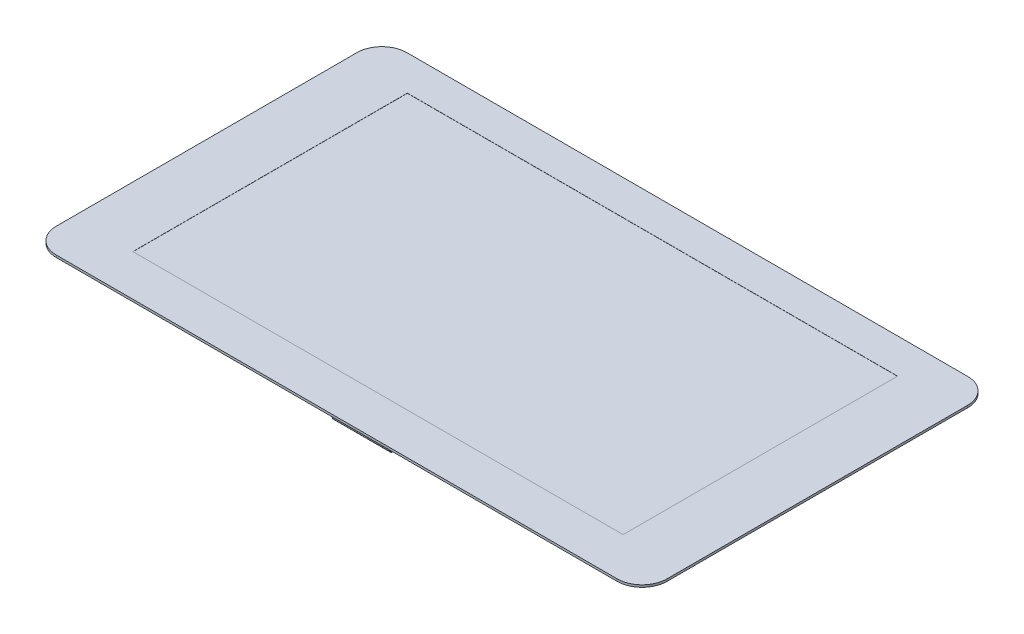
ISO-10303-21;
HEADER;
FILE_DESCRIPTION(('STEP AP214'),'2;1');
FILE_NAME('part.step','',(''),(''),'','','');
FILE_SCHEMA(('AUTOMOTIVE_DESIGN { 1 0 10303 214 1 1 1 1 }'));
ENDSEC;
DATA;
#1=APPLICATION_CONTEXT('core data for automotive mechanical design processes');
#2=APPLICATION_PROTOCOL_DEFINITION('international standard','automotive_design',2000,#1);
#3=PRODUCT_CONTEXT('',#1,'mechanical');
#4=PRODUCT('Part','Part','',(#3));
#5=PRODUCT_RELATED_PRODUCT_CATEGORY('part','',(#4));
#6=PRODUCT_DEFINITION_FORMATION('','',#4);
#7=PRODUCT_DEFINITION_CONTEXT('part definition',#1,'design');
#8=PRODUCT_DEFINITION('design','',#6,#7);
#9=PRODUCT_DEFINITION_SHAPE('','',#8);
#10=(LENGTH_UNIT() NAMED_UNIT(*) SI_UNIT(.MILLI.,.METRE.));
#11=(NAMED_UNIT(*) PLANE_ANGLE_UNIT() SI_UNIT($,.RADIAN.));
#12=(NAMED_UNIT(*) SI_UNIT($,.STERADIAN.) SOLID_ANGLE_UNIT());
#13=UNCERTAINTY_MEASURE_WITH_UNIT(LENGTH_MEASURE(1.E-05),#10,'distance_accuracy_value','');
#14=(GEOMETRIC_REPRESENTATION_CONTEXT(3) GLOBAL_UNCERTAINTY_ASSIGNED_CONTEXT((#13)) GLOBAL_UNIT_ASSIGNED_CONTEXT((#10,
#11,#12)) REPRESENTATION_CONTEXT('',''));
#15=CARTESIAN_POINT('',(0.,0.,0.));
#16=DIRECTION('',(0.,0.,1.));
#17=DIRECTION('',(1.,0.,0.));
#18=AXIS2_PLACEMENT_3D('',#15,#16,#17);
#19=CARTESIAN_POINT('',(2.31,-8.65,29.57106263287));
#20=DIRECTION('',(0.,0.,1.));
#21=DIRECTION('',(1.,0.,0.));
#22=AXIS2_PLACEMENT_3D('',#19,#20,#21);
#23=PLANE('',#22);
#24=DIRECTION('',(1.,0.,0.));
#25=VECTOR('',#24,1.);
#26=CARTESIAN_POINT('',(-4.94,-4.5,29.57106263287));
#27=LINE('',#26,#25);
#28=CARTESIAN_POINT('',(-4.94,-4.5,29.57106263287));
#29=VERTEX_POINT('',#28);
#30=CARTESIAN_POINT('',(2.31,-4.5,29.57106263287));
#31=VERTEX_POINT('',#30);
#32=EDGE_CURVE('E11',#29,#31,#27,.T.);
#33=ORIENTED_EDGE('',*,*,#32,.T.);
#34=DIRECTION('',(0.,1.,0.));
#35=VECTOR('',#34,1.);
#36=CARTESIAN_POINT('',(2.31,-4.65,29.57106263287));
#37=LINE('',#36,#35);
#38=CARTESIAN_POINT('',(2.31,-4.65,29.57106263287));
#39=VERTEX_POINT('',#38);
#40=EDGE_CURVE('E44',#39,#31,#37,.T.);
#41=ORIENTED_EDGE('',*,*,#40,.F.);
#42=DIRECTION('',(1.,0.,0.));
#43=VECTOR('',#42,1.);
#44=CARTESIAN_POINT('',(-4.94,-4.65,29.57106263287));
#45=LINE('',#44,#43);
#46=CARTESIAN_POINT('',(-4.94,-4.65,29.57106263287));
#47=VERTEX_POINT('',#46);
#48=EDGE_CURVE('E1224',#47,#39,#45,.T.);
#49=ORIENTED_EDGE('',*,*,#48,.F.);
#50=DIRECTION('',(0.,1.,0.));
#51=VECTOR('',#50,1.);
#52=CARTESIAN_POINT('',(-4.94,-4.65,29.57106263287));
#53=LINE('',#52,#51);
#54=EDGE_CURVE('E30',#47,#29,#53,.T.);
#55=ORIENTED_EDGE('',*,*,#54,.T.);
#56=EDGE_LOOP('',(#33,#41,#49,#55));
#57=FACE_BOUND('',#56,.T.);
#58=ADVANCED_FACE('F19',(#57),#23,.F.);
#59=CARTESIAN_POINT('',(-4.94,0.,83.9));
#60=DIRECTION('',(-1.,0.,0.));
#61=DIRECTION('',(0.,0.,1.));
#62=AXIS2_PLACEMENT_3D('',#59,#60,#61);
#63=PLANE('',#62);
#64=DIRECTION('',(0.,0.,-1.));
#65=VECTOR('',#64,1.);
#66=CARTESIAN_POINT('',(-4.94,-0.15,52.24));
#67=LINE('',#66,#65);
#68=CARTESIAN_POINT('',(-4.94,-0.15,52.24));
#69=VERTEX_POINT('',#68);
#70=CARTESIAN_POINT('',(-4.94,-0.15,51.74));
#71=VERTEX_POINT('',#70);
#72=EDGE_CURVE('E2303',#69,#71,#67,.T.);
#73=ORIENTED_EDGE('',*,*,#72,.T.);
#74=DIRECTION('',(0.,-1.,0.));
#75=VECTOR('',#74,1.);
#76=CARTESIAN_POINT('',(-4.94,-0.15,51.74));
#77=LINE('',#76,#75);
#78=CARTESIAN_POINT('',(-4.94,-0.2,51.74));
#79=VERTEX_POINT('',#78);
#80=EDGE_CURVE('E2288',#71,#79,#77,.T.);
#81=ORIENTED_EDGE('',*,*,#80,.T.);
#82=DIRECTION('',(0.,-1.,0.));
#83=VECTOR('',#82,1.);
#84=CARTESIAN_POINT('',(-4.94,-0.2,51.74));
#85=LINE('',#84,#83);
#86=CARTESIAN_POINT('',(-4.94,-0.3,51.74));
#87=VERTEX_POINT('',#86);
#88=EDGE_CURVE('E2284',#79,#87,#85,.T.);
#89=ORIENTED_EDGE('',*,*,#88,.T.);
#90=DIRECTION('',(0.,0.,-1.));
#91=VECTOR('',#90,1.);
#92=CARTESIAN_POINT('',(-4.94,-0.3,52.24));
#93=LINE('',#92,#91);
#94=CARTESIAN_POINT('',(-4.94,-0.3,52.24));
#95=VERTEX_POINT('',#94);
#96=EDGE_CURVE('E1354',#95,#87,#93,.T.);
#97=ORIENTED_EDGE('',*,*,#96,.F.);
#98=CARTESIAN_POINT('',(-4.94,-0.8,52.24));
#99=DIRECTION('',(1.,0.,0.));
#100=DIRECTION('',(0.,1.,0.));
#101=AXIS2_PLACEMENT_3D('',#98,#99,#100);
#102=CIRCLE('',#101,0.5);
#103=CARTESIAN_POINT('',(-4.94,-0.8,52.74));
#104=VERTEX_POINT('',#103);
#105=EDGE_CURVE('E2213',#95,#104,#102,.T.);
#106=ORIENTED_EDGE('',*,*,#105,.T.);
#107=DIRECTION('',(0.,1.,0.));
#108=VECTOR('',#107,1.);
#109=CARTESIAN_POINT('',(-4.94,-3.502069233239,52.74));
#110=LINE('',#109,#108);
#111=CARTESIAN_POINT('',(-4.94,-3.502069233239,52.74));
#112=VERTEX_POINT('',#111);
#113=EDGE_CURVE('E1329',#112,#104,#110,.T.);
#114=ORIENTED_EDGE('',*,*,#113,.F.);
#115=CARTESIAN_POINT('',(-4.94,-3.502069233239,51.74206923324));
#116=DIRECTION('',(-1.,0.,0.));
#117=DIRECTION('',(0.,-1.,0.));
#118=AXIS2_PLACEMENT_3D('',#115,#116,#117);
#119=CIRCLE('',#118,0.9979307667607);
#120=CARTESIAN_POINT('',(-4.94,-4.5,51.74206923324));
#121=VERTEX_POINT('',#120);
#122=EDGE_CURVE('E1304',#121,#112,#119,.T.);
#123=ORIENTED_EDGE('',*,*,#122,.F.);
#124=DIRECTION('',(0.,0.,1.));
#125=VECTOR('',#124,1.);
#126=CARTESIAN_POINT('',(-4.94,-4.5,29.57106263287));
#127=LINE('',#126,#125);
#128=EDGE_CURVE('E1287',#29,#121,#127,.T.);
#129=ORIENTED_EDGE('',*,*,#128,.F.);
#130=ORIENTED_EDGE('',*,*,#54,.F.);
#131=DIRECTION('',(0.,0.,-1.));
#132=VECTOR('',#131,1.);
#133=CARTESIAN_POINT('',(-4.94,-4.65,51.74206923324));
#134=LINE('',#133,#132);
#135=CARTESIAN_POINT('',(-4.94,-4.65,51.74206923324));
#136=VERTEX_POINT('',#135);
#137=EDGE_CURVE('E1039',#136,#47,#134,.T.);
#138=ORIENTED_EDGE('',*,*,#137,.F.);
#139=CARTESIAN_POINT('',(-4.94,-3.502069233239,51.74206923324));
#140=DIRECTION('',(1.,0.,0.));
#141=DIRECTION('',(0.,0.,1.));
#142=AXIS2_PLACEMENT_3D('',#139,#140,#141);
#143=CIRCLE('',#142,1.147930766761);
#144=CARTESIAN_POINT('',(-4.94,-3.502069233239,52.89));
#145=VERTEX_POINT('',#144);
#146=EDGE_CURVE('E987',#145,#136,#143,.T.);
#147=ORIENTED_EDGE('',*,*,#146,.F.);
#148=DIRECTION('',(0.,1.,0.));
#149=VECTOR('',#148,1.);
#150=CARTESIAN_POINT('',(-4.94,-3.502069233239,52.89));
#151=LINE('',#150,#149);
#152=CARTESIAN_POINT('',(-4.94,-0.8,52.89));
#153=VERTEX_POINT('',#152);
#154=EDGE_CURVE('E2209',#145,#153,#151,.T.);
#155=ORIENTED_EDGE('',*,*,#154,.T.);
#156=CARTESIAN_POINT('',(-4.94,-0.8,52.24));
#157=DIRECTION('',(-1.,0.,0.));
#158=DIRECTION('',(0.,0.,1.));
#159=AXIS2_PLACEMENT_3D('',#156,#157,#158);
#160=CIRCLE('',#159,0.65);
#161=EDGE_CURVE('E2184',#153,#69,#160,.T.);
#162=ORIENTED_EDGE('',*,*,#161,.T.);
#163=EDGE_LOOP('',(#73,#81,#89,#97,#106,#114,#123,#129,#130,#138,#147,#155,#162));
#164=FACE_BOUND('',#163,.T.);
#165=ADVANCED_FACE('F2677',(#164),#63,.T.);
#166=CARTESIAN_POINT('',(-312.6071732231,-0.8,52.24));
#167=DIRECTION('',(1.,0.,0.));
#168=DIRECTION('',(0.,1.,0.));
#169=AXIS2_PLACEMENT_3D('',#166,#167,#168);
#170=CYLINDRICAL_SURFACE('',#169,0.65);
#171=DIRECTION('',(1.,0.,0.));
#172=VECTOR('',#171,1.);
#173=CARTESIAN_POINT('',(-4.94,-0.15,52.24));
#174=LINE('',#173,#172);
#175=CARTESIAN_POINT('',(13.06,-0.15,52.24));
#176=VERTEX_POINT('',#175);
#177=EDGE_CURVE('E2027',#69,#176,#174,.T.);
#178=ORIENTED_EDGE('',*,*,#177,.F.);
#179=ORIENTED_EDGE('',*,*,#161,.F.);
#180=DIRECTION('',(1.,0.,0.));
#181=VECTOR('',#180,1.);
#182=CARTESIAN_POINT('',(-4.94,-0.8,52.89));
#183=LINE('',#182,#181);
#184=CARTESIAN_POINT('',(13.06,-0.8,52.89));
#185=VERTEX_POINT('',#184);
#186=EDGE_CURVE('E2170',#153,#185,#183,.T.);
#187=ORIENTED_EDGE('',*,*,#186,.T.);
#188=CARTESIAN_POINT('',(13.06,-0.8,52.24));
#189=DIRECTION('',(1.,0.,0.));
#190=DIRECTION('',(0.,1.,0.));
#191=AXIS2_PLACEMENT_3D('',#188,#189,#190);
#192=CIRCLE('',#191,0.65);
#193=EDGE_CURVE('E2012',#176,#185,#192,.T.);
#194=ORIENTED_EDGE('',*,*,#193,.F.);
#195=EDGE_LOOP('',(#178,#179,#187,#194));
#196=FACE_BOUND('',#195,.T.);
#197=ADVANCED_FACE('F2700',(#196),#170,.T.);
#198=CARTESIAN_POINT('',(13.06,0.,51.74));
#199=DIRECTION('',(1.,0.,0.));
#200=DIRECTION('',(0.,1.,0.));
#201=AXIS2_PLACEMENT_3D('',#198,#199,#200);
#202=PLANE('',#201);
#203=DIRECTION('',(0.,-1.,0.));
#204=VECTOR('',#203,1.);
#205=CARTESIAN_POINT('',(13.06,-0.8,52.89));
#206=LINE('',#205,#204);
#207=CARTESIAN_POINT('',(13.06,-3.502069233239,52.89));
#208=VERTEX_POINT('',#207);
#209=EDGE_CURVE('E2129',#185,#208,#206,.T.);
#210=ORIENTED_EDGE('',*,*,#209,.T.);
#211=CARTESIAN_POINT('',(13.06,-3.502069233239,51.74206923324));
#212=DIRECTION('',(1.,0.,0.));
#213=DIRECTION('',(0.,0.,1.));
#214=AXIS2_PLACEMENT_3D('',#211,#212,#213);
#215=CIRCLE('',#214,1.147930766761);
#216=CARTESIAN_POINT('',(13.06,-4.65,51.74206923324));
#217=VERTEX_POINT('',#216);
#218=EDGE_CURVE('E2121',#208,#217,#215,.T.);
#219=ORIENTED_EDGE('',*,*,#218,.T.);
#220=DIRECTION('',(0.,0.,-1.));
#221=VECTOR('',#220,1.);
#222=CARTESIAN_POINT('',(13.06,-4.65,51.74206923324));
#223=LINE('',#222,#221);
#224=CARTESIAN_POINT('',(13.06,-4.65,29.57106263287));
#225=VERTEX_POINT('',#224);
#226=EDGE_CURVE('E2106',#217,#225,#223,.T.);
#227=ORIENTED_EDGE('',*,*,#226,.T.);
#228=DIRECTION('',(0.,1.,0.));
#229=VECTOR('',#228,1.);
#230=CARTESIAN_POINT('',(13.06,-4.65,29.57106263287));
#231=LINE('',#230,#229);
#232=CARTESIAN_POINT('',(13.06,-4.5,29.57106263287));
#233=VERTEX_POINT('',#232);
#234=EDGE_CURVE('E2102',#225,#233,#231,.T.);
#235=ORIENTED_EDGE('',*,*,#234,.T.);
#236=DIRECTION('',(0.,0.,1.));
#237=VECTOR('',#236,1.);
#238=CARTESIAN_POINT('',(13.06,-4.5,29.57106263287));
#239=LINE('',#238,#237);
#240=CARTESIAN_POINT('',(13.06,-4.5,51.74206923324));
#241=VERTEX_POINT('',#240);
#242=EDGE_CURVE('E2083',#233,#241,#239,.T.);
#243=ORIENTED_EDGE('',*,*,#242,.T.);
#244=CARTESIAN_POINT('',(13.06,-3.502069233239,51.74206923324));
#245=DIRECTION('',(-1.,0.,0.));
#246=DIRECTION('',(0.,-1.,0.));
#247=AXIS2_PLACEMENT_3D('',#244,#245,#246);
#248=CIRCLE('',#247,0.9979307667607);
#249=CARTESIAN_POINT('',(13.06,-3.502069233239,52.74));
#250=VERTEX_POINT('',#249);
#251=EDGE_CURVE('E2079',#241,#250,#248,.T.);
#252=ORIENTED_EDGE('',*,*,#251,.T.);
#253=DIRECTION('',(0.,1.,0.));
#254=VECTOR('',#253,1.);
#255=CARTESIAN_POINT('',(13.06,-3.502069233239,52.74));
#256=LINE('',#255,#254);
#257=CARTESIAN_POINT('',(13.06,-0.8,52.74));
#258=VERTEX_POINT('',#257);
#259=EDGE_CURVE('E2084',#250,#258,#256,.T.);
#260=ORIENTED_EDGE('',*,*,#259,.T.);
#261=CARTESIAN_POINT('',(13.06,-0.8,52.24));
#262=DIRECTION('',(-1.,0.,0.));
#263=DIRECTION('',(0.,0.,1.));
#264=AXIS2_PLACEMENT_3D('',#261,#262,#263);
#265=CIRCLE('',#264,0.5);
#266=CARTESIAN_POINT('',(13.06,-0.3,52.24));
#267=VERTEX_POINT('',#266);
#268=EDGE_CURVE('E2011',#258,#267,#265,.T.);
#269=ORIENTED_EDGE('',*,*,#268,.T.);
#270=DIRECTION('',(0.,0.,1.));
#271=VECTOR('',#270,1.);
#272=CARTESIAN_POINT('',(13.06,-0.3,51.74));
#273=LINE('',#272,#271);
#274=CARTESIAN_POINT('',(13.06,-0.3,51.74));
#275=VERTEX_POINT('',#274);
#276=EDGE_CURVE('E1344',#275,#267,#273,.T.);
#277=ORIENTED_EDGE('',*,*,#276,.F.);
#278=DIRECTION('',(0.,-1.,0.));
#279=VECTOR('',#278,1.);
#280=CARTESIAN_POINT('',(13.06,-0.2,51.74));
#281=LINE('',#280,#279);
#282=CARTESIAN_POINT('',(13.06,-0.2,51.74));
#283=VERTEX_POINT('',#282);
#284=EDGE_CURVE('E1353',#283,#275,#281,.T.);
#285=ORIENTED_EDGE('',*,*,#284,.F.);
#286=DIRECTION('',(0.,-1.,0.));
#287=VECTOR('',#286,1.);
#288=CARTESIAN_POINT('',(13.06,-0.15,51.74));
#289=LINE('',#288,#287);
#290=CARTESIAN_POINT('',(13.06,-0.15,51.74));
#291=VERTEX_POINT('',#290);
#292=EDGE_CURVE('E2002',#291,#283,#289,.T.);
#293=ORIENTED_EDGE('',*,*,#292,.F.);
#294=DIRECTION('',(0.,0.,1.));
#295=VECTOR('',#294,1.);
#296=CARTESIAN_POINT('',(13.06,-0.15,51.74));
#297=LINE('',#296,#295);
#298=EDGE_CURVE('E2007',#291,#176,#297,.T.);
#299=ORIENTED_EDGE('',*,*,#298,.T.);
#300=ORIENTED_EDGE('',*,*,#193,.T.);
#301=EDGE_LOOP('',(#210,#219,#227,#235,#243,#252,#260,#269,#277,#285,#293,#299,#300));
#302=FACE_BOUND('',#301,.T.);
#303=ADVANCED_FACE('F2722',(#302),#202,.T.);
#304=CARTESIAN_POINT('',(0.,-0.15,0.));
#305=DIRECTION('',(0.,-1.,0.));
#306=DIRECTION('',(0.,0.,-1.));
#307=AXIS2_PLACEMENT_3D('',#304,#305,#306);
#308=PLANE('',#307);
#309=ORIENTED_EDGE('',*,*,#298,.F.);
#310=DIRECTION('',(1.,0.,0.));
#311=VECTOR('',#310,1.);
#312=CARTESIAN_POINT('',(-4.94,-0.15,51.74));
#313=LINE('',#312,#311);
#314=EDGE_CURVE('E1998',#71,#291,#313,.T.);
#315=ORIENTED_EDGE('',*,*,#314,.F.);
#316=ORIENTED_EDGE('',*,*,#72,.F.);
#317=ORIENTED_EDGE('',*,*,#177,.T.);
#318=EDGE_LOOP('',(#309,#315,#316,#317));
#319=FACE_BOUND('',#318,.T.);
#320=ADVANCED_FACE('F2755',(#319),#308,.F.);
#321=CARTESIAN_POINT('',(-4.94,0.,51.74));
#322=DIRECTION('',(0.,0.,-1.));
#323=DIRECTION('',(0.,-1.,0.));
#324=AXIS2_PLACEMENT_3D('',#321,#322,#323);
#325=PLANE('',#324);
#326=ORIENTED_EDGE('',*,*,#292,.T.);
#327=DIRECTION('',(1.,0.,0.));
#328=VECTOR('',#327,1.);
#329=CARTESIAN_POINT('',(-4.94,-0.2,51.74));
#330=LINE('',#329,#328);
#331=EDGE_CURVE('E1978',#79,#283,#330,.T.);
#332=ORIENTED_EDGE('',*,*,#331,.F.);
#333=ORIENTED_EDGE('',*,*,#80,.F.);
#334=ORIENTED_EDGE('',*,*,#314,.T.);
#335=EDGE_LOOP('',(#326,#332,#333,#334));
#336=FACE_BOUND('',#335,.T.);
#337=ADVANCED_FACE('F2788',(#336),#325,.T.);
#338=CARTESIAN_POINT('',(0.,-0.2,0.));
#339=DIRECTION('',(0.,-1.,0.));
#340=DIRECTION('',(0.,0.,-1.));
#341=AXIS2_PLACEMENT_3D('',#338,#339,#340);
#342=PLANE('',#341);
#343=ORIENTED_EDGE('',*,*,#331,.T.);
#344=DIRECTION('',(1.,0.,0.));
#345=VECTOR('',#344,1.);
#346=CARTESIAN_POINT('',(13.06,-0.2,51.74));
#347=LINE('',#346,#345);
#348=CARTESIAN_POINT('',(83.74,-0.2,51.74));
#349=VERTEX_POINT('',#348);
#350=EDGE_CURVE('E1970',#283,#349,#347,.T.);
#351=ORIENTED_EDGE('',*,*,#350,.T.);
#352=DIRECTION('',(0.,0.,-1.));
#353=VECTOR('',#352,1.);
#354=CARTESIAN_POINT('',(83.74,-0.2,51.74));
#355=LINE('',#354,#353);
#356=CARTESIAN_POINT('',(83.74,-0.2,-47.03));
#357=VERTEX_POINT('',#356);
#358=EDGE_CURVE('E1962',#349,#357,#355,.T.);
#359=ORIENTED_EDGE('',*,*,#358,.T.);
#360=DIRECTION('',(-1.,0.,0.));
#361=VECTOR('',#360,1.);
#362=CARTESIAN_POINT('',(83.74,-0.2,-47.03));
#363=LINE('',#362,#361);
#364=CARTESIAN_POINT('',(-80.14,-0.2,-47.03));
#365=VERTEX_POINT('',#364);
#366=EDGE_CURVE('E1948',#357,#365,#363,.T.);
#367=ORIENTED_EDGE('',*,*,#366,.T.);
#368=DIRECTION('',(0.,0.,1.));
#369=VECTOR('',#368,1.);
#370=CARTESIAN_POINT('',(-80.14,-0.2,-47.03));
#371=LINE('',#370,#369);
#372=CARTESIAN_POINT('',(-80.14,-0.2,51.74));
#373=VERTEX_POINT('',#372);
#374=EDGE_CURVE('E1944',#365,#373,#371,.T.);
#375=ORIENTED_EDGE('',*,*,#374,.T.);
#376=DIRECTION('',(1.,0.,0.));
#377=VECTOR('',#376,1.);
#378=CARTESIAN_POINT('',(-80.14,-0.2,51.74));
#379=LINE('',#378,#377);
#380=EDGE_CURVE('E1926',#373,#79,#379,.T.);
#381=ORIENTED_EDGE('',*,*,#380,.T.);
#382=EDGE_LOOP('',(#343,#351,#359,#367,#375,#381));
#383=FACE_BOUND('',#382,.T.);
#384=DIRECTION('',(0.,0.,-1.));
#385=VECTOR('',#384,1.);
#386=CARTESIAN_POINT('',(83.24,-0.2,51.24));
#387=LINE('',#386,#385);
#388=CARTESIAN_POINT('',(83.24,-0.2,51.24));
#389=VERTEX_POINT('',#388);
#390=CARTESIAN_POINT('',(83.24,-0.2,-46.53));
#391=VERTEX_POINT('',#390);
#392=EDGE_CURVE('E1692',#389,#391,#387,.T.);
#393=ORIENTED_EDGE('',*,*,#392,.F.);
#394=DIRECTION('',(1.,0.,0.));
#395=VECTOR('',#394,1.);
#396=CARTESIAN_POINT('',(-79.64,-0.2,51.24));
#397=LINE('',#396,#395);
#398=CARTESIAN_POINT('',(-79.64,-0.2,51.24));
#399=VERTEX_POINT('',#398);
#400=EDGE_CURVE('E1693',#399,#389,#397,.T.);
#401=ORIENTED_EDGE('',*,*,#400,.F.);
#402=DIRECTION('',(0.,0.,1.));
#403=VECTOR('',#402,1.);
#404=CARTESIAN_POINT('',(-79.64,-0.2,-46.53));
#405=LINE('',#404,#403);
#406=CARTESIAN_POINT('',(-79.64,-0.2,-46.53));
#407=VERTEX_POINT('',#406);
#408=EDGE_CURVE('E1910',#407,#399,#405,.T.);
#409=ORIENTED_EDGE('',*,*,#408,.F.);
#410=DIRECTION('',(-1.,0.,0.));
#411=VECTOR('',#410,1.);
#412=CARTESIAN_POINT('',(83.24,-0.2,-46.53));
#413=LINE('',#412,#411);
#414=EDGE_CURVE('E1730',#391,#407,#413,.T.);
#415=ORIENTED_EDGE('',*,*,#414,.F.);
#416=EDGE_LOOP('',(#393,#401,#409,#415));
#417=FACE_BOUND('',#416,.T.);
#418=ADVANCED_FACE('F2797',(#383,#417),#342,.F.);
#419=CARTESIAN_POINT('',(83.24,0.,-46.53));
#420=DIRECTION('',(0.,0.,1.));
#421=DIRECTION('',(1.,0.,0.));
#422=AXIS2_PLACEMENT_3D('',#419,#420,#421);
#423=PLANE('',#422);
#424=DIRECTION('',(0.,-1.,0.));
#425=VECTOR('',#424,1.);
#426=CARTESIAN_POINT('',(83.24,0.,-46.53));
#427=LINE('',#426,#425);
#428=CARTESIAN_POINT('',(83.24,0.,-46.53));
#429=VERTEX_POINT('',#428);
#430=EDGE_CURVE('E1922',#429,#391,#427,.T.);
#431=ORIENTED_EDGE('',*,*,#430,.T.);
#432=ORIENTED_EDGE('',*,*,#414,.T.);
#433=DIRECTION('',(0.,-1.,0.));
#434=VECTOR('',#433,1.);
#435=CARTESIAN_POINT('',(-79.64,0.,-46.53));
#436=LINE('',#435,#434);
#437=CARTESIAN_POINT('',(-79.64,0.,-46.53));
#438=VERTEX_POINT('',#437);
#439=EDGE_CURVE('E1906',#438,#407,#436,.T.);
#440=ORIENTED_EDGE('',*,*,#439,.F.);
#441=DIRECTION('',(-1.,0.,0.));
#442=VECTOR('',#441,1.);
#443=CARTESIAN_POINT('',(83.24,0.,-46.53));
#444=LINE('',#443,#442);
#445=EDGE_CURVE('E1702',#429,#438,#444,.T.);
#446=ORIENTED_EDGE('',*,*,#445,.F.);
#447=EDGE_LOOP('',(#431,#432,#440,#446));
#448=FACE_BOUND('',#447,.T.);
#449=ADVANCED_FACE('F2829',(#448),#423,.F.);
#450=CARTESIAN_POINT('',(0.,0.,0.));
#451=DIRECTION('',(0.,1.,0.));
#452=DIRECTION('',(1.,0.,0.));
#453=AXIS2_PLACEMENT_3D('',#450,#451,#452);
#454=PLANE('',#453);
#455=CARTESIAN_POINT('',(-88.6,0.,48.52));
#456=DIRECTION('',(0.,1.,0.));
#457=DIRECTION('',(-1.,0.,-1.127129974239E-13));
#458=AXIS2_PLACEMENT_3D('',#455,#456,#457);
#459=CIRCLE('',#458,7.88);
#460=CARTESIAN_POINT('',(-96.48,0.,48.52));
#461=VERTEX_POINT('',#460);
#462=CARTESIAN_POINT('',(-88.6,0.,56.4));
#463=VERTEX_POINT('',#462);
#464=EDGE_CURVE('E1878',#461,#463,#459,.T.);
#465=ORIENTED_EDGE('',*,*,#464,.F.);
#466=DIRECTION('',(0.,0.,1.));
#467=VECTOR('',#466,1.);
#468=CARTESIAN_POINT('',(-96.48,0.,-46.48));
#469=LINE('',#468,#467);
#470=CARTESIAN_POINT('',(-96.48,0.,-46.48));
#471=VERTEX_POINT('',#470);
#472=EDGE_CURVE('E1869',#471,#461,#469,.T.);
#473=ORIENTED_EDGE('',*,*,#472,.F.);
#474=CARTESIAN_POINT('',(-88.6,0.,-46.48));
#475=DIRECTION('',(0.,1.,0.));
#476=DIRECTION('',(0.,0.,-1.));
#477=AXIS2_PLACEMENT_3D('',#474,#475,#476);
#478=CIRCLE('',#477,7.88);
#479=CARTESIAN_POINT('',(-88.6,0.,-54.36));
#480=VERTEX_POINT('',#479);
#481=EDGE_CURVE('E1864',#480,#471,#478,.T.);
#482=ORIENTED_EDGE('',*,*,#481,.F.);
#483=DIRECTION('',(-1.,0.,0.));
#484=VECTOR('',#483,1.);
#485=CARTESIAN_POINT('',(88.6,0.,-54.36));
#486=LINE('',#485,#484);
#487=CARTESIAN_POINT('',(88.6,0.,-54.36));
#488=VERTEX_POINT('',#487);
#489=EDGE_CURVE('E1853',#488,#480,#486,.T.);
#490=ORIENTED_EDGE('',*,*,#489,.F.);
#491=CARTESIAN_POINT('',(88.6,0.,-46.48));
#492=DIRECTION('',(0.,1.,0.));
#493=DIRECTION('',(1.,0.,1.127129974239E-13));
#494=AXIS2_PLACEMENT_3D('',#491,#492,#493);
#495=CIRCLE('',#494,7.88);
#496=CARTESIAN_POINT('',(96.48,0.,-46.48));
#497=VERTEX_POINT('',#496);
#498=EDGE_CURVE('E1720',#497,#488,#495,.T.);
#499=ORIENTED_EDGE('',*,*,#498,.F.);
#500=DIRECTION('',(0.,0.,-1.));
#501=VECTOR('',#500,1.);
#502=CARTESIAN_POINT('',(96.48,0.,48.52));
#503=LINE('',#502,#501);
#504=CARTESIAN_POINT('',(96.48,0.,48.52));
#505=VERTEX_POINT('',#504);
#506=EDGE_CURVE('E1721',#505,#497,#503,.T.);
#507=ORIENTED_EDGE('',*,*,#506,.F.);
#508=CARTESIAN_POINT('',(88.6,0.,48.52));
#509=DIRECTION('',(0.,1.,0.));
#510=DIRECTION('',(0.,0.,1.));
#511=AXIS2_PLACEMENT_3D('',#508,#509,#510);
#512=CIRCLE('',#511,7.88);
#513=CARTESIAN_POINT('',(88.6,0.,56.4));
#514=VERTEX_POINT('',#513);
#515=EDGE_CURVE('E2240',#514,#505,#512,.T.);
#516=ORIENTED_EDGE('',*,*,#515,.F.);
#517=DIRECTION('',(1.,0.,0.));
#518=VECTOR('',#517,1.);
#519=CARTESIAN_POINT('',(-88.6,0.,56.4));
#520=LINE('',#519,#518);
#521=EDGE_CURVE('E1822',#463,#514,#520,.T.);
#522=ORIENTED_EDGE('',*,*,#521,.F.);
#523=EDGE_LOOP('',(#465,#473,#482,#490,#499,#507,#516,#522));
#524=FACE_BOUND('',#523,.T.);
#525=DIRECTION('',(1.,0.,0.));
#526=VECTOR('',#525,1.);
#527=CARTESIAN_POINT('',(-88.6,0.,-53.86));
#528=LINE('',#527,#526);
#529=CARTESIAN_POINT('',(-88.6,0.,-53.86));
#530=VERTEX_POINT('',#529);
#531=CARTESIAN_POINT('',(88.6,0.,-53.86));
#532=VERTEX_POINT('',#531);
#533=EDGE_CURVE('E1517',#530,#532,#528,.T.);
#534=ORIENTED_EDGE('',*,*,#533,.F.);
#535=CARTESIAN_POINT('',(-88.6,0.,-46.48));
#536=DIRECTION('',(0.,-1.,0.));
#537=DIRECTION('',(-1.,0.,2.301080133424E-13));
#538=AXIS2_PLACEMENT_3D('',#535,#536,#537);
#539=CIRCLE('',#538,7.38);
#540=CARTESIAN_POINT('',(-95.98,0.,-46.48));
#541=VERTEX_POINT('',#540);
#542=EDGE_CURVE('E1507',#541,#530,#539,.T.);
#543=ORIENTED_EDGE('',*,*,#542,.F.);
#544=DIRECTION('',(0.,0.,-1.));
#545=VECTOR('',#544,1.);
#546=CARTESIAN_POINT('',(-95.98,0.,48.52));
#547=LINE('',#546,#545);
#548=CARTESIAN_POINT('',(-95.98,0.,48.52));
#549=VERTEX_POINT('',#548);
#550=EDGE_CURVE('E1508',#549,#541,#547,.T.);
#551=ORIENTED_EDGE('',*,*,#550,.F.);
#552=CARTESIAN_POINT('',(-88.6,0.,48.52));
#553=DIRECTION('',(0.,-1.,0.));
#554=DIRECTION('',(-1.174609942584E-13,0.,1.));
#555=AXIS2_PLACEMENT_3D('',#552,#553,#554);
#556=CIRCLE('',#555,7.38);
#557=CARTESIAN_POINT('',(-88.6,0.,55.9));
#558=VERTEX_POINT('',#557);
#559=EDGE_CURVE('E1782',#558,#549,#556,.T.);
#560=ORIENTED_EDGE('',*,*,#559,.F.);
#561=DIRECTION('',(-1.,0.,0.));
#562=VECTOR('',#561,1.);
#563=CARTESIAN_POINT('',(88.6,0.,55.9));
#564=LINE('',#563,#562);
#565=CARTESIAN_POINT('',(88.6,0.,55.9));
#566=VERTEX_POINT('',#565);
#567=EDGE_CURVE('E1768',#566,#558,#564,.T.);
#568=ORIENTED_EDGE('',*,*,#567,.F.);
#569=CARTESIAN_POINT('',(88.6,0.,48.52));
#570=DIRECTION('',(0.,-1.,0.));
#571=DIRECTION('',(1.,0.,-2.301080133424E-13));
#572=AXIS2_PLACEMENT_3D('',#569,#570,#571);
#573=CIRCLE('',#572,7.38);
#574=CARTESIAN_POINT('',(95.98,0.,48.52));
#575=VERTEX_POINT('',#574);
#576=EDGE_CURVE('E1473',#575,#566,#573,.T.);
#577=ORIENTED_EDGE('',*,*,#576,.F.);
#578=DIRECTION('',(0.,0.,1.));
#579=VECTOR('',#578,1.);
#580=CARTESIAN_POINT('',(95.98,0.,-46.48));
#581=LINE('',#580,#579);
#582=CARTESIAN_POINT('',(95.98,0.,-46.48));
#583=VERTEX_POINT('',#582);
#584=EDGE_CURVE('E1463',#583,#575,#581,.T.);
#585=ORIENTED_EDGE('',*,*,#584,.F.);
#586=CARTESIAN_POINT('',(88.6,0.,-46.48));
#587=DIRECTION('',(0.,-1.,0.));
#588=DIRECTION('',(0.,0.,-1.));
#589=AXIS2_PLACEMENT_3D('',#586,#587,#588);
#590=CIRCLE('',#589,7.38);
#591=EDGE_CURVE('E1535',#532,#583,#590,.T.);
#592=ORIENTED_EDGE('',*,*,#591,.F.);
#593=EDGE_LOOP('',(#534,#543,#551,#560,#568,#577,#585,#592));
#594=FACE_BOUND('',#593,.T.);
#595=ADVANCED_FACE('F2851',(#524,#594),#454,.F.);
#596=CARTESIAN_POINT('',(0.,0.,0.));
#597=DIRECTION('',(0.,1.,0.));
#598=DIRECTION('',(1.,0.,0.));
#599=AXIS2_PLACEMENT_3D('',#596,#597,#598);
#600=PLANE('',#599);
#601=DIRECTION('',(0.,0.,-1.));
#602=VECTOR('',#601,1.);
#603=CARTESIAN_POINT('',(84.45196482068,0.,52.07177594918));
#604=LINE('',#603,#602);
#605=CARTESIAN_POINT('',(84.45196482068,0.,52.07177594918));
#606=VERTEX_POINT('',#605);
#607=CARTESIAN_POINT('',(84.45196482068,0.,-47.69374215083));
#608=VERTEX_POINT('',#607);
#609=EDGE_CURVE('E1430',#606,#608,#604,.T.);
#610=ORIENTED_EDGE('',*,*,#609,.F.);
#611=DIRECTION('',(1.,0.,0.));
#612=VECTOR('',#611,1.);
#613=CARTESIAN_POINT('',(14.87915070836,0.,52.07177594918));
#614=LINE('',#613,#612);
#615=CARTESIAN_POINT('',(14.87915070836,0.,52.07177594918));
#616=VERTEX_POINT('',#615);
#617=EDGE_CURVE('E1421',#616,#606,#614,.T.);
#618=ORIENTED_EDGE('',*,*,#617,.F.);
#619=DIRECTION('',(0.,0.,-1.));
#620=VECTOR('',#619,1.);
#621=CARTESIAN_POINT('',(14.87915070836,0.,53.91201775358));
#622=LINE('',#621,#620);
#623=CARTESIAN_POINT('',(14.87915070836,0.,53.91201775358));
#624=VERTEX_POINT('',#623);
#625=EDGE_CURVE('E1412',#624,#616,#622,.T.);
#626=ORIENTED_EDGE('',*,*,#625,.F.);
#627=DIRECTION('',(1.,0.,0.));
#628=VECTOR('',#627,1.);
#629=CARTESIAN_POINT('',(-6.637108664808,0.,53.91201775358));
#630=LINE('',#629,#628);
#631=CARTESIAN_POINT('',(-6.637108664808,0.,53.91201775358));
#632=VERTEX_POINT('',#631);
#633=EDGE_CURVE('E1402',#632,#624,#630,.T.);
#634=ORIENTED_EDGE('',*,*,#633,.F.);
#635=DIRECTION('',(0.,0.,1.));
#636=VECTOR('',#635,1.);
#637=CARTESIAN_POINT('',(-6.637108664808,0.,52.07177594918));
#638=LINE('',#637,#636);
#639=CARTESIAN_POINT('',(-6.637108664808,0.,52.07177594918));
#640=VERTEX_POINT('',#639);
#641=EDGE_CURVE('E1403',#640,#632,#638,.T.);
#642=ORIENTED_EDGE('',*,*,#641,.F.);
#643=DIRECTION('',(1.,0.,0.));
#644=VECTOR('',#643,1.);
#645=CARTESIAN_POINT('',(-80.89295100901,0.,52.07177594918));
#646=LINE('',#645,#644);
#647=CARTESIAN_POINT('',(-80.89295100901,0.,52.07177594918));
#648=VERTEX_POINT('',#647);
#649=EDGE_CURVE('E1393',#648,#640,#646,.T.);
#650=ORIENTED_EDGE('',*,*,#649,.F.);
#651=DIRECTION('',(0.,0.,1.));
#652=VECTOR('',#651,1.);
#653=CARTESIAN_POINT('',(-80.89295100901,0.,-47.69374215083));
#654=LINE('',#653,#652);
#655=CARTESIAN_POINT('',(-80.89295100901,0.,-47.69374215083));
#656=VERTEX_POINT('',#655);
#657=EDGE_CURVE('E1377',#656,#648,#654,.T.);
#658=ORIENTED_EDGE('',*,*,#657,.F.);
#659=DIRECTION('',(-1.,0.,0.));
#660=VECTOR('',#659,1.);
#661=CARTESIAN_POINT('',(84.45196482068,0.,-47.69374215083));
#662=LINE('',#661,#660);
#663=EDGE_CURVE('E1440',#608,#656,#662,.T.);
#664=ORIENTED_EDGE('',*,*,#663,.F.);
#665=EDGE_LOOP('',(#610,#618,#626,#634,#642,#650,#658,#664));
#666=FACE_BOUND('',#665,.T.);
#667=DIRECTION('',(0.,0.,1.));
#668=VECTOR('',#667,1.);
#669=CARTESIAN_POINT('',(-79.64,0.,-46.53));
#670=LINE('',#669,#668);
#671=CARTESIAN_POINT('',(-79.64,0.,51.24));
#672=VERTEX_POINT('',#671);
#673=EDGE_CURVE('E1726',#438,#672,#670,.T.);
#674=ORIENTED_EDGE('',*,*,#673,.T.);
#675=DIRECTION('',(1.,0.,0.));
#676=VECTOR('',#675,1.);
#677=CARTESIAN_POINT('',(-79.64,0.,51.24));
#678=LINE('',#677,#676);
#679=CARTESIAN_POINT('',(83.24,0.,51.24));
#680=VERTEX_POINT('',#679);
#681=EDGE_CURVE('E1711',#672,#680,#678,.T.);
#682=ORIENTED_EDGE('',*,*,#681,.T.);
#683=DIRECTION('',(0.,0.,-1.));
#684=VECTOR('',#683,1.);
#685=CARTESIAN_POINT('',(83.24,0.,51.24));
#686=LINE('',#685,#684);
#687=EDGE_CURVE('E1707',#680,#429,#686,.T.);
#688=ORIENTED_EDGE('',*,*,#687,.T.);
#689=ORIENTED_EDGE('',*,*,#445,.T.);
#690=EDGE_LOOP('',(#674,#682,#688,#689));
#691=FACE_BOUND('',#690,.T.);
#692=ADVANCED_FACE('F2690',(#666,#691),#600,.F.);
#693=CARTESIAN_POINT('',(83.24,0.,51.24));
#694=DIRECTION('',(-1.,0.,0.));
#695=DIRECTION('',(0.,0.,1.));
#696=AXIS2_PLACEMENT_3D('',#693,#694,#695);
#697=PLANE('',#696);
#698=DIRECTION('',(0.,-1.,0.));
#699=VECTOR('',#698,1.);
#700=CARTESIAN_POINT('',(83.24,0.,51.24));
#701=LINE('',#700,#699);
#702=EDGE_CURVE('E1698',#680,#389,#701,.T.);
#703=ORIENTED_EDGE('',*,*,#702,.T.);
#704=ORIENTED_EDGE('',*,*,#392,.T.);
#705=ORIENTED_EDGE('',*,*,#430,.F.);
#706=ORIENTED_EDGE('',*,*,#687,.F.);
#707=EDGE_LOOP('',(#703,#704,#705,#706));
#708=FACE_BOUND('',#707,.T.);
#709=ADVANCED_FACE('F2684',(#708),#697,.F.);
#710=CARTESIAN_POINT('',(-79.64,0.,51.24));
#711=DIRECTION('',(0.,0.,-1.));
#712=DIRECTION('',(0.,-1.,0.));
#713=AXIS2_PLACEMENT_3D('',#710,#711,#712);
#714=PLANE('',#713);
#715=DIRECTION('',(0.,-1.,0.));
#716=VECTOR('',#715,1.);
#717=CARTESIAN_POINT('',(-79.64,0.,51.24));
#718=LINE('',#717,#716);
#719=EDGE_CURVE('E1688',#672,#399,#718,.T.);
#720=ORIENTED_EDGE('',*,*,#719,.T.);
#721=ORIENTED_EDGE('',*,*,#400,.T.);
#722=ORIENTED_EDGE('',*,*,#702,.F.);
#723=ORIENTED_EDGE('',*,*,#681,.F.);
#724=EDGE_LOOP('',(#720,#721,#722,#723));
#725=FACE_BOUND('',#724,.T.);
#726=ADVANCED_FACE('F2689',(#725),#714,.F.);
#727=CARTESIAN_POINT('',(-79.64,0.,-46.53));
#728=DIRECTION('',(1.,0.,0.));
#729=DIRECTION('',(0.,1.,0.));
#730=AXIS2_PLACEMENT_3D('',#727,#728,#729);
#731=PLANE('',#730);
#732=ORIENTED_EDGE('',*,*,#439,.T.);
#733=ORIENTED_EDGE('',*,*,#408,.T.);
#734=ORIENTED_EDGE('',*,*,#719,.F.);
#735=ORIENTED_EDGE('',*,*,#673,.F.);
#736=EDGE_LOOP('',(#732,#733,#734,#735));
#737=FACE_BOUND('',#736,.T.);
#738=ADVANCED_FACE('F2899',(#737),#731,.F.);
#739=CARTESIAN_POINT('',(-88.6,0.,56.4));
#740=DIRECTION('',(0.,0.,1.));
#741=DIRECTION('',(1.,0.,0.));
#742=AXIS2_PLACEMENT_3D('',#739,#740,#741);
#743=PLANE('',#742);
#744=DIRECTION('',(0.,1.,0.));
#745=VECTOR('',#744,1.);
#746=CARTESIAN_POINT('',(88.6,0.,56.4));
#747=LINE('',#746,#745);
#748=CARTESIAN_POINT('',(88.6,0.7,56.4));
#749=VERTEX_POINT('',#748);
#750=EDGE_CURVE('E1826',#514,#749,#747,.T.);
#751=ORIENTED_EDGE('',*,*,#750,.T.);
#752=DIRECTION('',(1.,0.,0.));
#753=VECTOR('',#752,1.);
#754=CARTESIAN_POINT('',(-88.6,0.7,56.4));
#755=LINE('',#754,#753);
#756=CARTESIAN_POINT('',(-88.6,0.7,56.4));
#757=VERTEX_POINT('',#756);
#758=EDGE_CURVE('E1658',#757,#749,#755,.T.);
#759=ORIENTED_EDGE('',*,*,#758,.F.);
#760=DIRECTION('',(0.,1.,0.));
#761=VECTOR('',#760,1.);
#762=CARTESIAN_POINT('',(-88.6,0.,56.4));
#763=LINE('',#762,#761);
#764=EDGE_CURVE('E1827',#463,#757,#763,.T.);
#765=ORIENTED_EDGE('',*,*,#764,.F.);
#766=ORIENTED_EDGE('',*,*,#521,.T.);
#767=EDGE_LOOP('',(#751,#759,#765,#766));
#768=FACE_BOUND('',#767,.T.);
#769=ADVANCED_FACE('F2778',(#768),#743,.T.);
#770=CARTESIAN_POINT('',(-88.6,0.,48.52));
#771=DIRECTION('',(0.,1.,0.));
#772=DIRECTION('',(1.,0.,0.));
#773=AXIS2_PLACEMENT_3D('',#770,#771,#772);
#774=CYLINDRICAL_SURFACE('',#773,7.88);
#775=ORIENTED_EDGE('',*,*,#764,.T.);
#776=CARTESIAN_POINT('',(-88.6,0.7,48.52));
#777=DIRECTION('',(0.,1.,0.));
#778=DIRECTION('',(-1.,0.,-1.127129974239E-13));
#779=AXIS2_PLACEMENT_3D('',#776,#777,#778);
#780=CIRCLE('',#779,7.88);
#781=CARTESIAN_POINT('',(-96.48,0.7,48.52));
#782=VERTEX_POINT('',#781);
#783=EDGE_CURVE('E1683',#782,#757,#780,.T.);
#784=ORIENTED_EDGE('',*,*,#783,.F.);
#785=DIRECTION('',(0.,1.,0.));
#786=VECTOR('',#785,1.);
#787=CARTESIAN_POINT('',(-96.48,0.,48.52));
#788=LINE('',#787,#786);
#789=EDGE_CURVE('E1872',#461,#782,#788,.T.);
#790=ORIENTED_EDGE('',*,*,#789,.F.);
#791=ORIENTED_EDGE('',*,*,#464,.T.);
#792=EDGE_LOOP('',(#775,#784,#790,#791));
#793=FACE_BOUND('',#792,.T.);
#794=ADVANCED_FACE('F2767',(#793),#774,.T.);
#795=CARTESIAN_POINT('',(-96.48,0.,-46.48));
#796=DIRECTION('',(-1.,0.,0.));
#797=DIRECTION('',(0.,0.,1.));
#798=AXIS2_PLACEMENT_3D('',#795,#796,#797);
#799=PLANE('',#798);
#800=ORIENTED_EDGE('',*,*,#789,.T.);
#801=DIRECTION('',(0.,0.,1.));
#802=VECTOR('',#801,1.);
#803=CARTESIAN_POINT('',(-96.48,0.7,-46.48));
#804=LINE('',#803,#802);
#805=CARTESIAN_POINT('',(-96.48,0.7,-46.48));
#806=VERTEX_POINT('',#805);
#807=EDGE_CURVE('E1993',#806,#782,#804,.T.);
#808=ORIENTED_EDGE('',*,*,#807,.F.);
#809=DIRECTION('',(0.,1.,0.));
#810=VECTOR('',#809,1.);
#811=CARTESIAN_POINT('',(-96.48,0.,-46.48));
#812=LINE('',#811,#810);
#813=EDGE_CURVE('E1873',#471,#806,#812,.T.);
#814=ORIENTED_EDGE('',*,*,#813,.F.);
#815=ORIENTED_EDGE('',*,*,#472,.T.);
#816=EDGE_LOOP('',(#800,#808,#814,#815));
#817=FACE_BOUND('',#816,.T.);
#818=ADVANCED_FACE('F2761',(#817),#799,.T.);
#819=CARTESIAN_POINT('',(-88.6,0.,-46.48));
#820=DIRECTION('',(0.,1.,0.));
#821=DIRECTION('',(1.,0.,0.));
#822=AXIS2_PLACEMENT_3D('',#819,#820,#821);
#823=CYLINDRICAL_SURFACE('',#822,7.88);
#824=ORIENTED_EDGE('',*,*,#813,.T.);
#825=CARTESIAN_POINT('',(-88.6,0.7,-46.48));
#826=DIRECTION('',(0.,1.,0.));
#827=DIRECTION('',(0.,0.,-1.));
#828=AXIS2_PLACEMENT_3D('',#825,#826,#827);
#829=CIRCLE('',#828,7.88);
#830=CARTESIAN_POINT('',(-88.6,0.7,-54.36));
#831=VERTEX_POINT('',#830);
#832=EDGE_CURVE('E1676',#831,#806,#829,.T.);
#833=ORIENTED_EDGE('',*,*,#832,.F.);
#834=DIRECTION('',(0.,1.,0.));
#835=VECTOR('',#834,1.);
#836=CARTESIAN_POINT('',(-88.6,0.,-54.36));
#837=LINE('',#836,#835);
#838=EDGE_CURVE('E1856',#480,#831,#837,.T.);
#839=ORIENTED_EDGE('',*,*,#838,.F.);
#840=ORIENTED_EDGE('',*,*,#481,.T.);
#841=EDGE_LOOP('',(#824,#833,#839,#840));
#842=FACE_BOUND('',#841,.T.);
#843=ADVANCED_FACE('F2766',(#842),#823,.T.);
#844=CARTESIAN_POINT('',(88.6,0.,-54.36));
#845=DIRECTION('',(0.,0.,-1.));
#846=DIRECTION('',(0.,-1.,0.));
#847=AXIS2_PLACEMENT_3D('',#844,#845,#846);
#848=PLANE('',#847);
#849=ORIENTED_EDGE('',*,*,#838,.T.);
#850=DIRECTION('',(-1.,0.,0.));
#851=VECTOR('',#850,1.);
#852=CARTESIAN_POINT('',(88.6,0.7,-54.36));
#853=LINE('',#852,#851);
#854=CARTESIAN_POINT('',(88.6,0.7,-54.36));
#855=VERTEX_POINT('',#854);
#856=EDGE_CURVE('E1672',#855,#831,#853,.T.);
#857=ORIENTED_EDGE('',*,*,#856,.F.);
#858=DIRECTION('',(0.,1.,0.));
#859=VECTOR('',#858,1.);
#860=CARTESIAN_POINT('',(88.6,0.,-54.36));
#861=LINE('',#860,#859);
#862=EDGE_CURVE('E1848',#488,#855,#861,.T.);
#863=ORIENTED_EDGE('',*,*,#862,.F.);
#864=ORIENTED_EDGE('',*,*,#489,.T.);
#865=EDGE_LOOP('',(#849,#857,#863,#864));
#866=FACE_BOUND('',#865,.T.);
#867=ADVANCED_FACE('F2872',(#866),#848,.T.);
#868=CARTESIAN_POINT('',(88.6,0.,-46.48));
#869=DIRECTION('',(0.,1.,0.));
#870=DIRECTION('',(1.,0.,0.));
#871=AXIS2_PLACEMENT_3D('',#868,#869,#870);
#872=CYLINDRICAL_SURFACE('',#871,7.88);
#873=ORIENTED_EDGE('',*,*,#862,.T.);
#874=CARTESIAN_POINT('',(88.6,0.7,-46.48));
#875=DIRECTION('',(0.,1.,0.));
#876=DIRECTION('',(1.,0.,1.127129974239E-13));
#877=AXIS2_PLACEMENT_3D('',#874,#875,#876);
#878=CIRCLE('',#877,7.88);
#879=CARTESIAN_POINT('',(96.48,0.7,-46.48));
#880=VERTEX_POINT('',#879);
#881=EDGE_CURVE('E1667',#880,#855,#878,.T.);
#882=ORIENTED_EDGE('',*,*,#881,.F.);
#883=DIRECTION('',(0.,1.,0.));
#884=VECTOR('',#883,1.);
#885=CARTESIAN_POINT('',(96.48,0.,-46.48));
#886=LINE('',#885,#884);
#887=EDGE_CURVE('E1716',#497,#880,#886,.T.);
#888=ORIENTED_EDGE('',*,*,#887,.F.);
#889=ORIENTED_EDGE('',*,*,#498,.T.);
#890=EDGE_LOOP('',(#873,#882,#888,#889));
#891=FACE_BOUND('',#890,.T.);
#892=ADVANCED_FACE('F2866',(#891),#872,.T.);
#893=CARTESIAN_POINT('',(96.48,0.,48.52));
#894=DIRECTION('',(1.,0.,0.));
#895=DIRECTION('',(0.,1.,0.));
#896=AXIS2_PLACEMENT_3D('',#893,#894,#895);
#897=PLANE('',#896);
#898=ORIENTED_EDGE('',*,*,#887,.T.);
#899=DIRECTION('',(0.,0.,-1.));
#900=VECTOR('',#899,1.);
#901=CARTESIAN_POINT('',(96.48,0.7,48.52));
#902=LINE('',#901,#900);
#903=CARTESIAN_POINT('',(96.48,0.7,48.52));
#904=VERTEX_POINT('',#903);
#905=EDGE_CURVE('E1659',#904,#880,#902,.T.);
#906=ORIENTED_EDGE('',*,*,#905,.F.);
#907=DIRECTION('',(0.,1.,0.));
#908=VECTOR('',#907,1.);
#909=CARTESIAN_POINT('',(96.48,0.,48.52));
#910=LINE('',#909,#908);
#911=EDGE_CURVE('E1834',#505,#904,#910,.T.);
#912=ORIENTED_EDGE('',*,*,#911,.F.);
#913=ORIENTED_EDGE('',*,*,#506,.T.);
#914=EDGE_LOOP('',(#898,#906,#912,#913));
#915=FACE_BOUND('',#914,.T.);
#916=ADVANCED_FACE('F2871',(#915),#897,.T.);
#917=CARTESIAN_POINT('',(88.6,0.,48.52));
#918=DIRECTION('',(0.,1.,0.));
#919=DIRECTION('',(1.,0.,0.));
#920=AXIS2_PLACEMENT_3D('',#917,#918,#919);
#921=CYLINDRICAL_SURFACE('',#920,7.88);
#922=ORIENTED_EDGE('',*,*,#911,.T.);
#923=CARTESIAN_POINT('',(88.6,0.7,48.52));
#924=DIRECTION('',(0.,1.,0.));
#925=DIRECTION('',(0.,0.,1.));
#926=AXIS2_PLACEMENT_3D('',#923,#924,#925);
#927=CIRCLE('',#926,7.88);
#928=EDGE_CURVE('E1654',#749,#904,#927,.T.);
#929=ORIENTED_EDGE('',*,*,#928,.F.);
#930=ORIENTED_EDGE('',*,*,#750,.F.);
#931=ORIENTED_EDGE('',*,*,#515,.T.);
#932=EDGE_LOOP('',(#922,#929,#930,#931));
#933=FACE_BOUND('',#932,.T.);
#934=ADVANCED_FACE('F2939',(#933),#921,.T.);
#935=CARTESIAN_POINT('',(0.,0.7,0.));
#936=DIRECTION('',(0.,1.,0.));
#937=DIRECTION('',(1.,0.,0.));
#938=AXIS2_PLACEMENT_3D('',#935,#936,#937);
#939=PLANE('',#938);
#940=ORIENTED_EDGE('',*,*,#807,.T.);
#941=ORIENTED_EDGE('',*,*,#783,.T.);
#942=ORIENTED_EDGE('',*,*,#758,.T.);
#943=ORIENTED_EDGE('',*,*,#928,.T.);
#944=ORIENTED_EDGE('',*,*,#905,.T.);
#945=ORIENTED_EDGE('',*,*,#881,.T.);
#946=ORIENTED_EDGE('',*,*,#856,.T.);
#947=ORIENTED_EDGE('',*,*,#832,.T.);
#948=EDGE_LOOP('',(#940,#941,#942,#943,#944,#945,#946,#947));
#949=FACE_BOUND('',#948,.T.);
#950=DIRECTION('',(0.,0.,1.));
#951=VECTOR('',#950,1.);
#952=CARTESIAN_POINT('',(77.44,0.7,-43.36));
#953=LINE('',#952,#951);
#954=CARTESIAN_POINT('',(77.44,0.7,-43.36));
#955=VERTEX_POINT('',#954);
#956=CARTESIAN_POINT('',(77.44,0.7,43.36));
#957=VERTEX_POINT('',#956);
#958=EDGE_CURVE('E1649',#955,#957,#953,.T.);
#959=ORIENTED_EDGE('',*,*,#958,.T.);
#960=DIRECTION('',(-1.,0.,0.));
#961=VECTOR('',#960,1.);
#962=CARTESIAN_POINT('',(77.44,0.7,43.36));
#963=LINE('',#962,#961);
#964=CARTESIAN_POINT('',(-77.44,0.7,43.36));
#965=VERTEX_POINT('',#964);
#966=EDGE_CURVE('E1640',#957,#965,#963,.T.);
#967=ORIENTED_EDGE('',*,*,#966,.T.);
#968=DIRECTION('',(0.,0.,-1.));
#969=VECTOR('',#968,1.);
#970=CARTESIAN_POINT('',(-77.44,0.7,43.36));
#971=LINE('',#970,#969);
#972=CARTESIAN_POINT('',(-77.44,0.7,-43.36));
#973=VERTEX_POINT('',#972);
#974=EDGE_CURVE('E1636',#965,#973,#971,.T.);
#975=ORIENTED_EDGE('',*,*,#974,.T.);
#976=DIRECTION('',(1.,0.,0.));
#977=VECTOR('',#976,1.);
#978=CARTESIAN_POINT('',(-77.44,0.7,-43.36));
#979=LINE('',#978,#977);
#980=EDGE_CURVE('E1641',#973,#955,#979,.T.);
#981=ORIENTED_EDGE('',*,*,#980,.T.);
#982=EDGE_LOOP('',(#959,#967,#975,#981));
#983=FACE_BOUND('',#982,.T.);
#984=ADVANCED_FACE('F2969',(#949,#983),#939,.T.);
#985=CARTESIAN_POINT('',(-77.44,0.,-43.36));
#986=DIRECTION('',(0.,0.,1.));
#987=DIRECTION('',(1.,0.,0.));
#988=AXIS2_PLACEMENT_3D('',#985,#986,#987);
#989=PLANE('',#988);
#990=DIRECTION('',(0.,1.,0.));
#991=VECTOR('',#990,1.);
#992=CARTESIAN_POINT('',(77.44,0.65,-43.36));
#993=LINE('',#992,#991);
#994=CARTESIAN_POINT('',(77.44,0.65,-43.36));
#995=VERTEX_POINT('',#994);
#996=EDGE_CURVE('E1617',#995,#955,#993,.T.);
#997=ORIENTED_EDGE('',*,*,#996,.T.);
#998=ORIENTED_EDGE('',*,*,#980,.F.);
#999=DIRECTION('',(0.,1.,0.));
#1000=VECTOR('',#999,1.);
#1001=CARTESIAN_POINT('',(-77.44,0.65,-43.36));
#1002=LINE('',#1001,#1000);
#1003=CARTESIAN_POINT('',(-77.44,0.65,-43.36));
#1004=VERTEX_POINT('',#1003);
#1005=EDGE_CURVE('E1603',#1004,#973,#1002,.T.);
#1006=ORIENTED_EDGE('',*,*,#1005,.F.);
#1007=DIRECTION('',(1.,0.,0.));
#1008=VECTOR('',#1007,1.);
#1009=CARTESIAN_POINT('',(-77.44,0.65,-43.36));
#1010=LINE('',#1009,#1008);
#1011=EDGE_CURVE('E1588',#1004,#995,#1010,.T.);
#1012=ORIENTED_EDGE('',*,*,#1011,.T.);
#1013=EDGE_LOOP('',(#997,#998,#1006,#1012));
#1014=FACE_BOUND('',#1013,.T.);
#1015=ADVANCED_FACE('F2979',(#1014),#989,.T.);
#1016=CARTESIAN_POINT('',(0.,0.65,0.));
#1017=DIRECTION('',(0.,1.,0.));
#1018=DIRECTION('',(1.,0.,0.));
#1019=AXIS2_PLACEMENT_3D('',#1016,#1017,#1018);
#1020=PLANE('',#1019);
#1021=DIRECTION('',(0.,0.,-1.));
#1022=VECTOR('',#1021,1.);
#1023=CARTESIAN_POINT('',(-77.44,0.65,43.36));
#1024=LINE('',#1023,#1022);
#1025=CARTESIAN_POINT('',(-77.44,0.65,43.36));
#1026=VERTEX_POINT('',#1025);
#1027=EDGE_CURVE('E1561',#1026,#1004,#1024,.T.);
#1028=ORIENTED_EDGE('',*,*,#1027,.F.);
#1029=DIRECTION('',(-1.,0.,0.));
#1030=VECTOR('',#1029,1.);
#1031=CARTESIAN_POINT('',(77.44,0.65,43.36));
#1032=LINE('',#1031,#1030);
#1033=CARTESIAN_POINT('',(77.44,0.65,43.36));
#1034=VERTEX_POINT('',#1033);
#1035=EDGE_CURVE('E1579',#1034,#1026,#1032,.T.);
#1036=ORIENTED_EDGE('',*,*,#1035,.F.);
#1037=DIRECTION('',(0.,0.,1.));
#1038=VECTOR('',#1037,1.);
#1039=CARTESIAN_POINT('',(77.44,0.65,-43.36));
#1040=LINE('',#1039,#1038);
#1041=EDGE_CURVE('E1578',#995,#1034,#1040,.T.);
#1042=ORIENTED_EDGE('',*,*,#1041,.F.);
#1043=ORIENTED_EDGE('',*,*,#1011,.F.);
#1044=EDGE_LOOP('',(#1028,#1036,#1042,#1043));
#1045=FACE_BOUND('',#1044,.T.);
#1046=ADVANCED_FACE('F3003',(#1045),#1020,.T.);
#1047=CARTESIAN_POINT('',(77.44,0.,-43.36));
#1048=DIRECTION('',(-1.,0.,0.));
#1049=DIRECTION('',(0.,0.,1.));
#1050=AXIS2_PLACEMENT_3D('',#1047,#1048,#1049);
#1051=PLANE('',#1050);
#1052=DIRECTION('',(0.,1.,0.));
#1053=VECTOR('',#1052,1.);
#1054=CARTESIAN_POINT('',(77.44,0.65,43.36));
#1055=LINE('',#1054,#1053);
#1056=EDGE_CURVE('E1584',#1034,#957,#1055,.T.);
#1057=ORIENTED_EDGE('',*,*,#1056,.T.);
#1058=ORIENTED_EDGE('',*,*,#958,.F.);
#1059=ORIENTED_EDGE('',*,*,#996,.F.);
#1060=ORIENTED_EDGE('',*,*,#1041,.T.);
#1061=EDGE_LOOP('',(#1057,#1058,#1059,#1060));
#1062=FACE_BOUND('',#1061,.T.);
#1063=ADVANCED_FACE('F2712',(#1062),#1051,.T.);
#1064=CARTESIAN_POINT('',(77.44,0.,43.36));
#1065=DIRECTION('',(0.,0.,-1.));
#1066=DIRECTION('',(0.,-1.,0.));
#1067=AXIS2_PLACEMENT_3D('',#1064,#1065,#1066);
#1068=PLANE('',#1067);
#1069=DIRECTION('',(0.,1.,0.));
#1070=VECTOR('',#1069,1.);
#1071=CARTESIAN_POINT('',(-77.44,0.65,43.36));
#1072=LINE('',#1071,#1070);
#1073=EDGE_CURVE('E1574',#1026,#965,#1072,.T.);
#1074=ORIENTED_EDGE('',*,*,#1073,.T.);
#1075=ORIENTED_EDGE('',*,*,#966,.F.);
#1076=ORIENTED_EDGE('',*,*,#1056,.F.);
#1077=ORIENTED_EDGE('',*,*,#1035,.T.);
#1078=EDGE_LOOP('',(#1074,#1075,#1076,#1077));
#1079=FACE_BOUND('',#1078,.T.);
#1080=ADVANCED_FACE('F2706',(#1079),#1068,.T.);
#1081=CARTESIAN_POINT('',(-77.44,0.,43.36));
#1082=DIRECTION('',(1.,0.,0.));
#1083=DIRECTION('',(0.,1.,0.));
#1084=AXIS2_PLACEMENT_3D('',#1081,#1082,#1083);
#1085=PLANE('',#1084);
#1086=ORIENTED_EDGE('',*,*,#1005,.T.);
#1087=ORIENTED_EDGE('',*,*,#974,.F.);
#1088=ORIENTED_EDGE('',*,*,#1073,.F.);
#1089=ORIENTED_EDGE('',*,*,#1027,.T.);
#1090=EDGE_LOOP('',(#1086,#1087,#1088,#1089));
#1091=FACE_BOUND('',#1090,.T.);
#1092=ADVANCED_FACE('F2711',(#1091),#1085,.T.);
#1093=CARTESIAN_POINT('',(88.6,0.,-46.48));
#1094=DIRECTION('',(0.,-1.,0.));
#1095=DIRECTION('',(-1.,0.,0.));
#1096=AXIS2_PLACEMENT_3D('',#1093,#1094,#1095);
#1097=CYLINDRICAL_SURFACE('',#1096,7.38);
#1098=DIRECTION('',(0.,-1.,0.));
#1099=VECTOR('',#1098,1.);
#1100=CARTESIAN_POINT('',(95.98,0.,-46.48));
#1101=LINE('',#1100,#1099);
#1102=CARTESIAN_POINT('',(95.98,-0.3,-46.48));
#1103=VERTEX_POINT('',#1102);
#1104=EDGE_CURVE('E1557',#583,#1103,#1101,.T.);
#1105=ORIENTED_EDGE('',*,*,#1104,.T.);
#1106=CARTESIAN_POINT('',(88.6,-0.3,-46.48));
#1107=DIRECTION('',(0.,-1.,0.));
#1108=DIRECTION('',(0.,0.,-1.));
#1109=AXIS2_PLACEMENT_3D('',#1106,#1107,#1108);
#1110=CIRCLE('',#1109,7.38);
#1111=CARTESIAN_POINT('',(88.6,-0.3,-53.86));
#1112=VERTEX_POINT('',#1111);
#1113=EDGE_CURVE('E1526',#1112,#1103,#1110,.T.);
#1114=ORIENTED_EDGE('',*,*,#1113,.F.);
#1115=DIRECTION('',(0.,-1.,0.));
#1116=VECTOR('',#1115,1.);
#1117=CARTESIAN_POINT('',(88.6,0.,-53.86));
#1118=LINE('',#1117,#1116);
#1119=EDGE_CURVE('E1531',#532,#1112,#1118,.T.);
#1120=ORIENTED_EDGE('',*,*,#1119,.F.);
#1121=ORIENTED_EDGE('',*,*,#591,.T.);
#1122=EDGE_LOOP('',(#1105,#1114,#1120,#1121));
#1123=FACE_BOUND('',#1122,.T.);
#1124=ADVANCED_FACE('F3047',(#1123),#1097,.T.);
#1125=CARTESIAN_POINT('',(-88.6,0.,-53.86));
#1126=DIRECTION('',(0.,0.,-1.));
#1127=DIRECTION('',(0.,-1.,0.));
#1128=AXIS2_PLACEMENT_3D('',#1125,#1126,#1127);
#1129=PLANE('',#1128);
#1130=ORIENTED_EDGE('',*,*,#1119,.T.);
#1131=DIRECTION('',(1.,0.,0.));
#1132=VECTOR('',#1131,1.);
#1133=CARTESIAN_POINT('',(-88.6,-0.3,-53.86));
#1134=LINE('',#1133,#1132);
#1135=CARTESIAN_POINT('',(-88.6,-0.3,-53.86));
#1136=VERTEX_POINT('',#1135);
#1137=EDGE_CURVE('E1522',#1136,#1112,#1134,.T.);
#1138=ORIENTED_EDGE('',*,*,#1137,.F.);
#1139=DIRECTION('',(0.,-1.,0.));
#1140=VECTOR('',#1139,1.);
#1141=CARTESIAN_POINT('',(-88.6,0.,-53.86));
#1142=LINE('',#1141,#1140);
#1143=EDGE_CURVE('E1513',#530,#1136,#1142,.T.);
#1144=ORIENTED_EDGE('',*,*,#1143,.F.);
#1145=ORIENTED_EDGE('',*,*,#533,.T.);
#1146=EDGE_LOOP('',(#1130,#1138,#1144,#1145));
#1147=FACE_BOUND('',#1146,.T.);
#1148=ADVANCED_FACE('F3056',(#1147),#1129,.T.);
#1149=CARTESIAN_POINT('',(-88.6,0.,-46.48));
#1150=DIRECTION('',(0.,-1.,0.));
#1151=DIRECTION('',(-1.,0.,0.));
#1152=AXIS2_PLACEMENT_3D('',#1149,#1150,#1151);
#1153=CYLINDRICAL_SURFACE('',#1152,7.38);
#1154=ORIENTED_EDGE('',*,*,#1143,.T.);
#1155=CARTESIAN_POINT('',(-88.6,-0.3,-46.48));
#1156=DIRECTION('',(0.,-1.,0.));
#1157=DIRECTION('',(-1.,0.,2.281824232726E-13));
#1158=AXIS2_PLACEMENT_3D('',#1155,#1156,#1157);
#1159=CIRCLE('',#1158,7.38);
#1160=CARTESIAN_POINT('',(-95.98,-0.3,-46.48));
#1161=VERTEX_POINT('',#1160);
#1162=EDGE_CURVE('E1498',#1161,#1136,#1159,.T.);
#1163=ORIENTED_EDGE('',*,*,#1162,.F.);
#1164=DIRECTION('',(0.,-1.,0.));
#1165=VECTOR('',#1164,1.);
#1166=CARTESIAN_POINT('',(-95.98,0.,-46.48));
#1167=LINE('',#1166,#1165);
#1168=EDGE_CURVE('E1503',#541,#1161,#1167,.T.);
#1169=ORIENTED_EDGE('',*,*,#1168,.F.);
#1170=ORIENTED_EDGE('',*,*,#542,.T.);
#1171=EDGE_LOOP('',(#1154,#1163,#1169,#1170));
#1172=FACE_BOUND('',#1171,.T.);
#1173=ADVANCED_FACE('F3078',(#1172),#1153,.T.);
#1174=CARTESIAN_POINT('',(-95.98,0.,48.52));
#1175=DIRECTION('',(-1.,0.,0.));
#1176=DIRECTION('',(0.,0.,1.));
#1177=AXIS2_PLACEMENT_3D('',#1174,#1175,#1176);
#1178=PLANE('',#1177);
#1179=ORIENTED_EDGE('',*,*,#1168,.T.);
#1180=DIRECTION('',(0.,0.,-1.));
#1181=VECTOR('',#1180,1.);
#1182=CARTESIAN_POINT('',(-95.98,-0.3,48.52));
#1183=LINE('',#1182,#1181);
#1184=CARTESIAN_POINT('',(-95.98,-0.3,48.52));
#1185=VERTEX_POINT('',#1184);
#1186=EDGE_CURVE('E1490',#1185,#1161,#1183,.T.);
#1187=ORIENTED_EDGE('',*,*,#1186,.F.);
#1188=DIRECTION('',(0.,-1.,0.));
#1189=VECTOR('',#1188,1.);
#1190=CARTESIAN_POINT('',(-95.98,0.,48.52));
#1191=LINE('',#1190,#1189);
#1192=EDGE_CURVE('E1786',#549,#1185,#1191,.T.);
#1193=ORIENTED_EDGE('',*,*,#1192,.F.);
#1194=ORIENTED_EDGE('',*,*,#550,.T.);
#1195=EDGE_LOOP('',(#1179,#1187,#1193,#1194));
#1196=FACE_BOUND('',#1195,.T.);
#1197=ADVANCED_FACE('F3087',(#1196),#1178,.T.);
#1198=CARTESIAN_POINT('',(-88.6,0.,48.52));
#1199=DIRECTION('',(0.,-1.,0.));
#1200=DIRECTION('',(-1.,0.,0.));
#1201=AXIS2_PLACEMENT_3D('',#1198,#1199,#1200);
#1202=CYLINDRICAL_SURFACE('',#1201,7.38);
#1203=ORIENTED_EDGE('',*,*,#1192,.T.);
#1204=CARTESIAN_POINT('',(-88.6,-0.3,48.52));
#1205=DIRECTION('',(0.,-1.,0.));
#1206=DIRECTION('',(-1.155354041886E-13,0.,1.));
#1207=AXIS2_PLACEMENT_3D('',#1204,#1205,#1206);
#1208=CIRCLE('',#1207,7.38);
#1209=CARTESIAN_POINT('',(-88.6,-0.3,55.9));
#1210=VERTEX_POINT('',#1209);
#1211=EDGE_CURVE('E1482',#1210,#1185,#1208,.T.);
#1212=ORIENTED_EDGE('',*,*,#1211,.F.);
#1213=DIRECTION('',(0.,-1.,0.));
#1214=VECTOR('',#1213,1.);
#1215=CARTESIAN_POINT('',(-88.6,0.,55.9));
#1216=LINE('',#1215,#1214);
#1217=EDGE_CURVE('E1771',#558,#1210,#1216,.T.);
#1218=ORIENTED_EDGE('',*,*,#1217,.F.);
#1219=ORIENTED_EDGE('',*,*,#559,.T.);
#1220=EDGE_LOOP('',(#1203,#1212,#1218,#1219));
#1221=FACE_BOUND('',#1220,.T.);
#1222=ADVANCED_FACE('F3096',(#1221),#1202,.T.);
#1223=CARTESIAN_POINT('',(88.6,0.,55.9));
#1224=DIRECTION('',(0.,0.,1.));
#1225=DIRECTION('',(1.,0.,0.));
#1226=AXIS2_PLACEMENT_3D('',#1223,#1224,#1225);
#1227=PLANE('',#1226);
#1228=ORIENTED_EDGE('',*,*,#1217,.T.);
#1229=DIRECTION('',(-1.,0.,0.));
#1230=VECTOR('',#1229,1.);
#1231=CARTESIAN_POINT('',(88.6,-0.3,55.9));
#1232=LINE('',#1231,#1230);
#1233=CARTESIAN_POINT('',(88.6,-0.3,55.9));
#1234=VERTEX_POINT('',#1233);
#1235=EDGE_CURVE('E1478',#1234,#1210,#1232,.T.);
#1236=ORIENTED_EDGE('',*,*,#1235,.F.);
#1237=DIRECTION('',(0.,-1.,0.));
#1238=VECTOR('',#1237,1.);
#1239=CARTESIAN_POINT('',(88.6,0.,55.9));
#1240=LINE('',#1239,#1238);
#1241=EDGE_CURVE('E1763',#566,#1234,#1240,.T.);
#1242=ORIENTED_EDGE('',*,*,#1241,.F.);
#1243=ORIENTED_EDGE('',*,*,#567,.T.);
#1244=EDGE_LOOP('',(#1228,#1236,#1242,#1243));
#1245=FACE_BOUND('',#1244,.T.);
#1246=ADVANCED_FACE('F3118',(#1245),#1227,.T.);
#1247=CARTESIAN_POINT('',(88.6,0.,48.52));
#1248=DIRECTION('',(0.,-1.,0.));
#1249=DIRECTION('',(-1.,0.,0.));
#1250=AXIS2_PLACEMENT_3D('',#1247,#1248,#1249);
#1251=CYLINDRICAL_SURFACE('',#1250,7.38);
#1252=ORIENTED_EDGE('',*,*,#1241,.T.);
#1253=CARTESIAN_POINT('',(88.6,-0.3,48.52));
#1254=DIRECTION('',(0.,-1.,0.));
#1255=DIRECTION('',(1.,0.,-2.281824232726E-13));
#1256=AXIS2_PLACEMENT_3D('',#1253,#1254,#1255);
#1257=CIRCLE('',#1256,7.38);
#1258=CARTESIAN_POINT('',(95.98,-0.3,48.52));
#1259=VERTEX_POINT('',#1258);
#1260=EDGE_CURVE('E1464',#1259,#1234,#1257,.T.);
#1261=ORIENTED_EDGE('',*,*,#1260,.F.);
#1262=DIRECTION('',(0.,-1.,0.));
#1263=VECTOR('',#1262,1.);
#1264=CARTESIAN_POINT('',(95.98,0.,48.52));
#1265=LINE('',#1264,#1263);
#1266=EDGE_CURVE('E1469',#575,#1259,#1265,.T.);
#1267=ORIENTED_EDGE('',*,*,#1266,.F.);
#1268=ORIENTED_EDGE('',*,*,#576,.T.);
#1269=EDGE_LOOP('',(#1252,#1261,#1267,#1268));
#1270=FACE_BOUND('',#1269,.T.);
#1271=ADVANCED_FACE('F3137',(#1270),#1251,.T.);
#1272=CARTESIAN_POINT('',(95.98,0.,-46.48));
#1273=DIRECTION('',(1.,0.,0.));
#1274=DIRECTION('',(0.,1.,0.));
#1275=AXIS2_PLACEMENT_3D('',#1272,#1273,#1274);
#1276=PLANE('',#1275);
#1277=ORIENTED_EDGE('',*,*,#1266,.T.);
#1278=DIRECTION('',(0.,0.,1.));
#1279=VECTOR('',#1278,1.);
#1280=CARTESIAN_POINT('',(95.98,-0.3,-46.48));
#1281=LINE('',#1280,#1279);
#1282=EDGE_CURVE('E1459',#1103,#1259,#1281,.T.);
#1283=ORIENTED_EDGE('',*,*,#1282,.F.);
#1284=ORIENTED_EDGE('',*,*,#1104,.F.);
#1285=ORIENTED_EDGE('',*,*,#584,.T.);
#1286=EDGE_LOOP('',(#1277,#1283,#1284,#1285));
#1287=FACE_BOUND('',#1286,.T.);
#1288=ADVANCED_FACE('F3146',(#1287),#1276,.T.);
#1289=CARTESIAN_POINT('',(0.,-0.3,0.));
#1290=DIRECTION('',(0.,-1.,0.));
#1291=DIRECTION('',(0.,0.,-1.));
#1292=AXIS2_PLACEMENT_3D('',#1289,#1290,#1291);
#1293=PLANE('',#1292);
#1294=ORIENTED_EDGE('',*,*,#1282,.T.);
#1295=ORIENTED_EDGE('',*,*,#1260,.T.);
#1296=ORIENTED_EDGE('',*,*,#1235,.T.);
#1297=ORIENTED_EDGE('',*,*,#1211,.T.);
#1298=ORIENTED_EDGE('',*,*,#1186,.T.);
#1299=ORIENTED_EDGE('',*,*,#1162,.T.);
#1300=ORIENTED_EDGE('',*,*,#1137,.T.);
#1301=ORIENTED_EDGE('',*,*,#1113,.T.);
#1302=EDGE_LOOP('',(#1294,#1295,#1296,#1297,#1298,#1299,#1300,#1301));
#1303=FACE_BOUND('',#1302,.T.);
#1304=DIRECTION('',(0.,0.,1.));
#1305=VECTOR('',#1304,1.);
#1306=CARTESIAN_POINT('',(-80.89295100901,-0.3,-47.69374215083));
#1307=LINE('',#1306,#1305);
#1308=CARTESIAN_POINT('',(-80.89295100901,-0.3,-47.69374215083));
#1309=VERTEX_POINT('',#1308);
#1310=CARTESIAN_POINT('',(-80.89295100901,-0.3,52.07177594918));
#1311=VERTEX_POINT('',#1310);
#1312=EDGE_CURVE('E1542',#1309,#1311,#1307,.T.);
#1313=ORIENTED_EDGE('',*,*,#1312,.T.);
#1314=DIRECTION('',(1.,0.,0.));
#1315=VECTOR('',#1314,1.);
#1316=CARTESIAN_POINT('',(-80.89295100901,-0.3,52.07177594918));
#1317=LINE('',#1316,#1315);
#1318=CARTESIAN_POINT('',(-6.637108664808,-0.3,52.07177594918));
#1319=VERTEX_POINT('',#1318);
#1320=EDGE_CURVE('E1569',#1311,#1319,#1317,.T.);
#1321=ORIENTED_EDGE('',*,*,#1320,.T.);
#1322=DIRECTION('',(0.,0.,1.));
#1323=VECTOR('',#1322,1.);
#1324=CARTESIAN_POINT('',(-6.637108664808,-0.3,52.07177594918));
#1325=LINE('',#1324,#1323);
#1326=CARTESIAN_POINT('',(-6.637108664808,-0.3,53.91201775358));
#1327=VERTEX_POINT('',#1326);
#1328=EDGE_CURVE('E1551',#1319,#1327,#1325,.T.);
#1329=ORIENTED_EDGE('',*,*,#1328,.T.);
#1330=DIRECTION('',(1.,0.,0.));
#1331=VECTOR('',#1330,1.);
#1332=CARTESIAN_POINT('',(-6.637108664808,-0.3,53.91201775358));
#1333=LINE('',#1332,#1331);
#1334=CARTESIAN_POINT('',(14.87915070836,-0.3,53.91201775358));
#1335=VERTEX_POINT('',#1334);
#1336=EDGE_CURVE('E1547',#1327,#1335,#1333,.T.);
#1337=ORIENTED_EDGE('',*,*,#1336,.T.);
#1338=DIRECTION('',(0.,0.,-1.));
#1339=VECTOR('',#1338,1.);
#1340=CARTESIAN_POINT('',(14.87915070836,-0.3,53.91201775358));
#1341=LINE('',#1340,#1339);
#1342=CARTESIAN_POINT('',(14.87915070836,-0.3,52.07177594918));
#1343=VERTEX_POINT('',#1342);
#1344=EDGE_CURVE('E1552',#1335,#1343,#1341,.T.);
#1345=ORIENTED_EDGE('',*,*,#1344,.T.);
#1346=DIRECTION('',(1.,0.,0.));
#1347=VECTOR('',#1346,1.);
#1348=CARTESIAN_POINT('',(14.87915070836,-0.3,52.07177594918));
#1349=LINE('',#1348,#1347);
#1350=CARTESIAN_POINT('',(84.45196482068,-0.3,52.07177594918));
#1351=VERTEX_POINT('',#1350);
#1352=EDGE_CURVE('E2074',#1343,#1351,#1349,.T.);
#1353=ORIENTED_EDGE('',*,*,#1352,.T.);
#1354=DIRECTION('',(0.,0.,-1.));
#1355=VECTOR('',#1354,1.);
#1356=CARTESIAN_POINT('',(84.45196482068,-0.3,52.07177594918));
#1357=LINE('',#1356,#1355);
#1358=CARTESIAN_POINT('',(84.45196482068,-0.3,-47.69374215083));
#1359=VERTEX_POINT('',#1358);
#1360=EDGE_CURVE('E1454',#1351,#1359,#1357,.T.);
#1361=ORIENTED_EDGE('',*,*,#1360,.T.);
#1362=DIRECTION('',(-1.,0.,0.));
#1363=VECTOR('',#1362,1.);
#1364=CARTESIAN_POINT('',(84.45196482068,-0.3,-47.69374215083));
#1365=LINE('',#1364,#1363);
#1366=EDGE_CURVE('E1439',#1359,#1309,#1365,.T.);
#1367=ORIENTED_EDGE('',*,*,#1366,.T.);
#1368=EDGE_LOOP('',(#1313,#1321,#1329,#1337,#1345,#1353,#1361,#1367));
#1369=FACE_BOUND('',#1368,.T.);
#1370=ADVANCED_FACE('F3155',(#1303,#1369),#1293,.T.);
#1371=CARTESIAN_POINT('',(84.45196482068,0.,-47.69374215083));
#1372=DIRECTION('',(0.,0.,1.));
#1373=DIRECTION('',(1.,0.,0.));
#1374=AXIS2_PLACEMENT_3D('',#1371,#1372,#1373);
#1375=PLANE('',#1374);
#1376=DIRECTION('',(0.,-1.,0.));
#1377=VECTOR('',#1376,1.);
#1378=CARTESIAN_POINT('',(-80.89295100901,0.,-47.69374215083));
#1379=LINE('',#1378,#1377);
#1380=EDGE_CURVE('E1435',#656,#1309,#1379,.T.);
#1381=ORIENTED_EDGE('',*,*,#1380,.T.);
#1382=ORIENTED_EDGE('',*,*,#1366,.F.);
#1383=DIRECTION('',(0.,-1.,0.));
#1384=VECTOR('',#1383,1.);
#1385=CARTESIAN_POINT('',(84.45196482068,0.,-47.69374215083));
#1386=LINE('',#1385,#1384);
#1387=EDGE_CURVE('E1841',#608,#1359,#1386,.T.);
#1388=ORIENTED_EDGE('',*,*,#1387,.F.);
#1389=ORIENTED_EDGE('',*,*,#663,.T.);
#1390=EDGE_LOOP('',(#1381,#1382,#1388,#1389));
#1391=FACE_BOUND('',#1390,.T.);
#1392=ADVANCED_FACE('F3164',(#1391),#1375,.T.);
#1393=CARTESIAN_POINT('',(84.45196482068,0.,52.07177594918));
#1394=DIRECTION('',(-1.,0.,0.));
#1395=DIRECTION('',(0.,0.,1.));
#1396=AXIS2_PLACEMENT_3D('',#1393,#1394,#1395);
#1397=PLANE('',#1396);
#1398=ORIENTED_EDGE('',*,*,#1387,.T.);
#1399=ORIENTED_EDGE('',*,*,#1360,.F.);
#1400=DIRECTION('',(0.,-1.,0.));
#1401=VECTOR('',#1400,1.);
#1402=CARTESIAN_POINT('',(84.45196482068,0.,52.07177594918));
#1403=LINE('',#1402,#1401);
#1404=EDGE_CURVE('E1426',#606,#1351,#1403,.T.);
#1405=ORIENTED_EDGE('',*,*,#1404,.F.);
#1406=ORIENTED_EDGE('',*,*,#609,.T.);
#1407=EDGE_LOOP('',(#1398,#1399,#1405,#1406));
#1408=FACE_BOUND('',#1407,.T.);
#1409=ADVANCED_FACE('F3173',(#1408),#1397,.T.);
#1410=CARTESIAN_POINT('',(14.87915070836,0.,52.07177594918));
#1411=DIRECTION('',(0.,0.,-1.));
#1412=DIRECTION('',(0.,-1.,0.));
#1413=AXIS2_PLACEMENT_3D('',#1410,#1411,#1412);
#1414=PLANE('',#1413);
#1415=ORIENTED_EDGE('',*,*,#1404,.T.);
#1416=ORIENTED_EDGE('',*,*,#1352,.F.);
#1417=DIRECTION('',(0.,-1.,0.));
#1418=VECTOR('',#1417,1.);
#1419=CARTESIAN_POINT('',(14.87915070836,0.,52.07177594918));
#1420=LINE('',#1419,#1418);
#1421=EDGE_CURVE('E1417',#616,#1343,#1420,.T.);
#1422=ORIENTED_EDGE('',*,*,#1421,.F.);
#1423=ORIENTED_EDGE('',*,*,#617,.T.);
#1424=EDGE_LOOP('',(#1415,#1416,#1422,#1423));
#1425=FACE_BOUND('',#1424,.T.);
#1426=ADVANCED_FACE('F3195',(#1425),#1414,.T.);
#1427=CARTESIAN_POINT('',(14.87915070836,0.,53.91201775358));
#1428=DIRECTION('',(-1.,0.,0.));
#1429=DIRECTION('',(0.,0.,1.));
#1430=AXIS2_PLACEMENT_3D('',#1427,#1428,#1429);
#1431=PLANE('',#1430);
#1432=ORIENTED_EDGE('',*,*,#1421,.T.);
#1433=ORIENTED_EDGE('',*,*,#1344,.F.);
#1434=DIRECTION('',(0.,-1.,0.));
#1435=VECTOR('',#1434,1.);
#1436=CARTESIAN_POINT('',(14.87915070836,0.,53.91201775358));
#1437=LINE('',#1436,#1435);
#1438=EDGE_CURVE('E1408',#624,#1335,#1437,.T.);
#1439=ORIENTED_EDGE('',*,*,#1438,.F.);
#1440=ORIENTED_EDGE('',*,*,#625,.T.);
#1441=EDGE_LOOP('',(#1432,#1433,#1439,#1440));
#1442=FACE_BOUND('',#1441,.T.);
#1443=ADVANCED_FACE('F3185',(#1442),#1431,.T.);
#1444=CARTESIAN_POINT('',(-6.637108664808,0.,53.91201775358));
#1445=DIRECTION('',(0.,0.,-1.));
#1446=DIRECTION('',(0.,-1.,0.));
#1447=AXIS2_PLACEMENT_3D('',#1444,#1445,#1446);
#1448=PLANE('',#1447);
#1449=ORIENTED_EDGE('',*,*,#1438,.T.);
#1450=ORIENTED_EDGE('',*,*,#1336,.F.);
#1451=DIRECTION('',(0.,-1.,0.));
#1452=VECTOR('',#1451,1.);
#1453=CARTESIAN_POINT('',(-6.637108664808,0.,53.91201775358));
#1454=LINE('',#1453,#1452);
#1455=EDGE_CURVE('E1398',#632,#1327,#1454,.T.);
#1456=ORIENTED_EDGE('',*,*,#1455,.F.);
#1457=ORIENTED_EDGE('',*,*,#633,.T.);
#1458=EDGE_LOOP('',(#1449,#1450,#1456,#1457));
#1459=FACE_BOUND('',#1458,.T.);
#1460=ADVANCED_FACE('F3179',(#1459),#1448,.T.);
#1461=CARTESIAN_POINT('',(-6.637108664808,0.,52.07177594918));
#1462=DIRECTION('',(1.,0.,0.));
#1463=DIRECTION('',(0.,1.,0.));
#1464=AXIS2_PLACEMENT_3D('',#1461,#1462,#1463);
#1465=PLANE('',#1464);
#1466=ORIENTED_EDGE('',*,*,#1455,.T.);
#1467=ORIENTED_EDGE('',*,*,#1328,.F.);
#1468=DIRECTION('',(0.,-1.,0.));
#1469=VECTOR('',#1468,1.);
#1470=CARTESIAN_POINT('',(-6.637108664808,0.,52.07177594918));
#1471=LINE('',#1470,#1469);
#1472=EDGE_CURVE('E1737',#640,#1319,#1471,.T.);
#1473=ORIENTED_EDGE('',*,*,#1472,.F.);
#1474=ORIENTED_EDGE('',*,*,#641,.T.);
#1475=EDGE_LOOP('',(#1466,#1467,#1473,#1474));
#1476=FACE_BOUND('',#1475,.T.);
#1477=ADVANCED_FACE('F3184',(#1476),#1465,.T.);
#1478=CARTESIAN_POINT('',(-80.89295100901,0.,52.07177594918));
#1479=DIRECTION('',(0.,0.,-1.));
#1480=DIRECTION('',(0.,-1.,0.));
#1481=AXIS2_PLACEMENT_3D('',#1478,#1479,#1480);
#1482=PLANE('',#1481);
#1483=ORIENTED_EDGE('',*,*,#1472,.T.);
#1484=ORIENTED_EDGE('',*,*,#1320,.F.);
#1485=DIRECTION('',(0.,-1.,0.));
#1486=VECTOR('',#1485,1.);
#1487=CARTESIAN_POINT('',(-80.89295100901,0.,52.07177594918));
#1488=LINE('',#1487,#1486);
#1489=EDGE_CURVE('E1389',#648,#1311,#1488,.T.);
#1490=ORIENTED_EDGE('',*,*,#1489,.F.);
#1491=ORIENTED_EDGE('',*,*,#649,.T.);
#1492=EDGE_LOOP('',(#1483,#1484,#1490,#1491));
#1493=FACE_BOUND('',#1492,.T.);
#1494=ADVANCED_FACE('F3206',(#1493),#1482,.T.);
#1495=CARTESIAN_POINT('',(-80.89295100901,0.,-47.69374215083));
#1496=DIRECTION('',(1.,0.,0.));
#1497=DIRECTION('',(0.,1.,0.));
#1498=AXIS2_PLACEMENT_3D('',#1495,#1496,#1497);
#1499=PLANE('',#1498);
#1500=ORIENTED_EDGE('',*,*,#1489,.T.);
#1501=ORIENTED_EDGE('',*,*,#1312,.F.);
#1502=ORIENTED_EDGE('',*,*,#1380,.F.);
#1503=ORIENTED_EDGE('',*,*,#657,.T.);
#1504=EDGE_LOOP('',(#1500,#1501,#1502,#1503));
#1505=FACE_BOUND('',#1504,.T.);
#1506=ADVANCED_FACE('F3201',(#1505),#1499,.T.);
#1507=CARTESIAN_POINT('',(-80.14,0.,51.74));
#1508=DIRECTION('',(0.,0.,1.));
#1509=DIRECTION('',(1.,0.,0.));
#1510=AXIS2_PLACEMENT_3D('',#1507,#1508,#1509);
#1511=PLANE('',#1510);
#1512=ORIENTED_EDGE('',*,*,#88,.F.);
#1513=ORIENTED_EDGE('',*,*,#380,.F.);
#1514=DIRECTION('',(0.,-1.,0.));
#1515=VECTOR('',#1514,1.);
#1516=CARTESIAN_POINT('',(-80.14,-0.2,51.74));
#1517=LINE('',#1516,#1515);
#1518=CARTESIAN_POINT('',(-80.14,-1.3,51.74));
#1519=VERTEX_POINT('',#1518);
#1520=EDGE_CURVE('E1369',#373,#1519,#1517,.T.);
#1521=ORIENTED_EDGE('',*,*,#1520,.T.);
#1522=DIRECTION('',(1.,0.,0.));
#1523=VECTOR('',#1522,1.);
#1524=CARTESIAN_POINT('',(-80.14,-1.3,51.74));
#1525=LINE('',#1524,#1523);
#1526=CARTESIAN_POINT('',(83.74,-1.3,51.74));
#1527=VERTEX_POINT('',#1526);
#1528=EDGE_CURVE('E1365',#1519,#1527,#1525,.T.);
#1529=ORIENTED_EDGE('',*,*,#1528,.T.);
#1530=DIRECTION('',(0.,-1.,0.));
#1531=VECTOR('',#1530,1.);
#1532=CARTESIAN_POINT('',(83.74,-0.2,51.74));
#1533=LINE('',#1532,#1531);
#1534=EDGE_CURVE('E919',#349,#1527,#1533,.T.);
#1535=ORIENTED_EDGE('',*,*,#1534,.F.);
#1536=ORIENTED_EDGE('',*,*,#350,.F.);
#1537=ORIENTED_EDGE('',*,*,#284,.T.);
#1538=DIRECTION('',(-1.,0.,0.));
#1539=VECTOR('',#1538,1.);
#1540=CARTESIAN_POINT('',(13.06,-0.3,51.74));
#1541=LINE('',#1540,#1539);
#1542=EDGE_CURVE('E1349',#275,#87,#1541,.T.);
#1543=ORIENTED_EDGE('',*,*,#1542,.T.);
#1544=EDGE_LOOP('',(#1512,#1513,#1521,#1529,#1535,#1536,#1537,#1543));
#1545=FACE_BOUND('',#1544,.T.);
#1546=ADVANCED_FACE('F2992',(#1545),#1511,.T.);
#1547=CARTESIAN_POINT('',(0.,-0.3,0.));
#1548=DIRECTION('',(0.,-1.,0.));
#1549=DIRECTION('',(0.,0.,-1.));
#1550=AXIS2_PLACEMENT_3D('',#1547,#1548,#1549);
#1551=PLANE('',#1550);
#1552=ORIENTED_EDGE('',*,*,#96,.T.);
#1553=ORIENTED_EDGE('',*,*,#1542,.F.);
#1554=ORIENTED_EDGE('',*,*,#276,.T.);
#1555=DIRECTION('',(1.,0.,0.));
#1556=VECTOR('',#1555,1.);
#1557=CARTESIAN_POINT('',(-4.94,-0.3,52.24));
#1558=LINE('',#1557,#1556);
#1559=EDGE_CURVE('E1328',#95,#267,#1558,.T.);
#1560=ORIENTED_EDGE('',*,*,#1559,.F.);
#1561=EDGE_LOOP('',(#1552,#1553,#1554,#1560));
#1562=FACE_BOUND('',#1561,.T.);
#1563=ADVANCED_FACE('F2986',(#1562),#1551,.T.);
#1564=CARTESIAN_POINT('',(-312.3807982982,-0.8,52.24));
#1565=DIRECTION('',(1.,0.,0.));
#1566=DIRECTION('',(0.,1.,0.));
#1567=AXIS2_PLACEMENT_3D('',#1564,#1565,#1566);
#1568=CYLINDRICAL_SURFACE('',#1567,0.5);
#1569=ORIENTED_EDGE('',*,*,#268,.F.);
#1570=DIRECTION('',(1.,0.,0.));
#1571=VECTOR('',#1570,1.);
#1572=CARTESIAN_POINT('',(-4.94,-0.8,52.74));
#1573=LINE('',#1572,#1571);
#1574=EDGE_CURVE('E1319',#104,#258,#1573,.T.);
#1575=ORIENTED_EDGE('',*,*,#1574,.F.);
#1576=ORIENTED_EDGE('',*,*,#105,.F.);
#1577=ORIENTED_EDGE('',*,*,#1559,.T.);
#1578=EDGE_LOOP('',(#1569,#1575,#1576,#1577));
#1579=FACE_BOUND('',#1578,.T.);
#1580=ADVANCED_FACE('F2991',(#1579),#1568,.F.);
#1581=CARTESIAN_POINT('',(13.06,-3.502069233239,52.74));
#1582=DIRECTION('',(0.,0.,-1.));
#1583=DIRECTION('',(0.,-1.,0.));
#1584=AXIS2_PLACEMENT_3D('',#1581,#1582,#1583);
#1585=PLANE('',#1584);
#1586=ORIENTED_EDGE('',*,*,#259,.F.);
#1587=DIRECTION('',(-1.,0.,0.));
#1588=VECTOR('',#1587,1.);
#1589=CARTESIAN_POINT('',(13.06,-3.502069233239,52.74));
#1590=LINE('',#1589,#1588);
#1591=EDGE_CURVE('E1324',#250,#112,#1590,.T.);
#1592=ORIENTED_EDGE('',*,*,#1591,.T.);
#1593=ORIENTED_EDGE('',*,*,#113,.T.);
#1594=ORIENTED_EDGE('',*,*,#1574,.T.);
#1595=EDGE_LOOP('',(#1586,#1592,#1593,#1594));
#1596=FACE_BOUND('',#1595,.T.);
#1597=ADVANCED_FACE('F3293',(#1596),#1585,.T.);
#1598=CARTESIAN_POINT('',(13.06,-3.502069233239,51.74206923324));
#1599=DIRECTION('',(1.,0.,0.));
#1600=DIRECTION('',(0.,0.,1.));
#1601=AXIS2_PLACEMENT_3D('',#1598,#1599,#1600);
#1602=CYLINDRICAL_SURFACE('',#1601,0.9979307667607);
#1603=DIRECTION('',(-1.,0.,0.));
#1604=VECTOR('',#1603,1.);
#1605=CARTESIAN_POINT('',(13.06,-4.5,51.74206923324));
#1606=LINE('',#1605,#1604);
#1607=EDGE_CURVE('E1315',#241,#121,#1606,.T.);
#1608=ORIENTED_EDGE('',*,*,#1607,.T.);
#1609=ORIENTED_EDGE('',*,*,#122,.T.);
#1610=ORIENTED_EDGE('',*,*,#1591,.F.);
#1611=ORIENTED_EDGE('',*,*,#251,.F.);
#1612=EDGE_LOOP('',(#1608,#1609,#1610,#1611));
#1613=FACE_BOUND('',#1612,.T.);
#1614=ADVANCED_FACE('F3127',(#1613),#1602,.F.);
#1615=CARTESIAN_POINT('',(13.06,-4.5,28.54));
#1616=DIRECTION('',(0.,1.,0.));
#1617=DIRECTION('',(1.,0.,0.));
#1618=AXIS2_PLACEMENT_3D('',#1615,#1616,#1617);
#1619=PLANE('',#1618);
#1620=DIRECTION('',(0.,0.,1.));
#1621=VECTOR('',#1620,1.);
#1622=CARTESIAN_POINT('',(5.81,-4.5,28.54));
#1623=LINE('',#1622,#1621);
#1624=CARTESIAN_POINT('',(5.81,-4.5,28.54));
#1625=VERTEX_POINT('',#1624);
#1626=CARTESIAN_POINT('',(5.81,-4.5,29.57106263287));
#1627=VERTEX_POINT('',#1626);
#1628=EDGE_CURVE('E1210',#1625,#1627,#1623,.T.);
#1629=ORIENTED_EDGE('',*,*,#1628,.F.);
#1630=DIRECTION('',(-1.,0.,0.));
#1631=VECTOR('',#1630,1.);
#1632=CARTESIAN_POINT('',(5.81,-4.5,28.54));
#1633=LINE('',#1632,#1631);
#1634=CARTESIAN_POINT('',(2.31,-4.5,28.54));
#1635=VERTEX_POINT('',#1634);
#1636=EDGE_CURVE('E1296',#1625,#1635,#1633,.T.);
#1637=ORIENTED_EDGE('',*,*,#1636,.T.);
#1638=DIRECTION('',(0.,0.,1.));
#1639=VECTOR('',#1638,1.);
#1640=CARTESIAN_POINT('',(2.31,-4.5,28.54));
#1641=LINE('',#1640,#1639);
#1642=EDGE_CURVE('E1292',#1635,#31,#1641,.T.);
#1643=ORIENTED_EDGE('',*,*,#1642,.T.);
#1644=ORIENTED_EDGE('',*,*,#32,.F.);
#1645=ORIENTED_EDGE('',*,*,#128,.T.);
#1646=ORIENTED_EDGE('',*,*,#1607,.F.);
#1647=ORIENTED_EDGE('',*,*,#242,.F.);
#1648=DIRECTION('',(-1.,0.,0.));
#1649=VECTOR('',#1648,1.);
#1650=CARTESIAN_POINT('',(13.06,-4.5,29.57106263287));
#1651=LINE('',#1650,#1649);
#1652=EDGE_CURVE('E1279',#233,#1627,#1651,.T.);
#1653=ORIENTED_EDGE('',*,*,#1652,.T.);
#1654=EDGE_LOOP('',(#1629,#1637,#1643,#1644,#1645,#1646,#1647,#1653));
#1655=FACE_BOUND('',#1654,.T.);
#1656=ADVANCED_FACE('F3068',(#1655),#1619,.T.);
#1657=CARTESIAN_POINT('',(13.06,-8.65,29.57106263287));
#1658=DIRECTION('',(0.,0.,1.));
#1659=DIRECTION('',(1.,0.,0.));
#1660=AXIS2_PLACEMENT_3D('',#1657,#1658,#1659);
#1661=PLANE('',#1660);
#1662=DIRECTION('',(-1.,0.,0.));
#1663=VECTOR('',#1662,1.);
#1664=CARTESIAN_POINT('',(13.06,-4.65,29.57106263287));
#1665=LINE('',#1664,#1663);
#1666=CARTESIAN_POINT('',(5.81,-4.65,29.57106263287));
#1667=VERTEX_POINT('',#1666);
#1668=EDGE_CURVE('E1271',#225,#1667,#1665,.T.);
#1669=ORIENTED_EDGE('',*,*,#1668,.T.);
#1670=DIRECTION('',(0.,1.,0.));
#1671=VECTOR('',#1670,1.);
#1672=CARTESIAN_POINT('',(5.81,-4.65,29.57106263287));
#1673=LINE('',#1672,#1671);
#1674=EDGE_CURVE('E1263',#1667,#1627,#1673,.T.);
#1675=ORIENTED_EDGE('',*,*,#1674,.T.);
#1676=ORIENTED_EDGE('',*,*,#1652,.F.);
#1677=ORIENTED_EDGE('',*,*,#234,.F.);
#1678=EDGE_LOOP('',(#1669,#1675,#1676,#1677));
#1679=FACE_BOUND('',#1678,.T.);
#1680=ADVANCED_FACE('F3062',(#1679),#1661,.F.);
#1681=CARTESIAN_POINT('',(5.81,-8.65,29.57106263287));
#1682=DIRECTION('',(-1.,0.,0.));
#1683=DIRECTION('',(0.,0.,1.));
#1684=AXIS2_PLACEMENT_3D('',#1681,#1682,#1683);
#1685=PLANE('',#1684);
#1686=DIRECTION('',(0.,1.,0.));
#1687=VECTOR('',#1686,1.);
#1688=CARTESIAN_POINT('',(5.81,-8.65,11.74));
#1689=LINE('',#1688,#1687);
#1690=CARTESIAN_POINT('',(5.81,-8.65,11.74));
#1691=VERTEX_POINT('',#1690);
#1692=CARTESIAN_POINT('',(5.81,-8.5,11.74));
#1693=VERTEX_POINT('',#1692);
#1694=EDGE_CURVE('E1255',#1691,#1693,#1689,.T.);
#1695=ORIENTED_EDGE('',*,*,#1694,.T.);
#1696=DIRECTION('',(0.,0.,1.));
#1697=VECTOR('',#1696,1.);
#1698=CARTESIAN_POINT('',(5.81,-8.5,11.74));
#1699=LINE('',#1698,#1697);
#1700=CARTESIAN_POINT('',(5.81,-8.5,26.39));
#1701=VERTEX_POINT('',#1700);
#1702=EDGE_CURVE('E1241',#1693,#1701,#1699,.T.);
#1703=ORIENTED_EDGE('',*,*,#1702,.T.);
#1704=CARTESIAN_POINT('',(5.81,-7.5,26.39));
#1705=DIRECTION('',(1.,0.,0.));
#1706=DIRECTION('',(0.,0.,1.));
#1707=AXIS2_PLACEMENT_3D('',#1704,#1705,#1706);
#1708=CIRCLE('',#1707,1.);
#1709=CARTESIAN_POINT('',(5.81,-7.5,27.39));
#1710=VERTEX_POINT('',#1709);
#1711=EDGE_CURVE('E1101',#1710,#1701,#1708,.T.);
#1712=ORIENTED_EDGE('',*,*,#1711,.F.);
#1713=DIRECTION('',(0.,1.,0.));
#1714=VECTOR('',#1713,1.);
#1715=CARTESIAN_POINT('',(5.81,-7.5,27.39));
#1716=LINE('',#1715,#1714);
#1717=CARTESIAN_POINT('',(5.81,-5.65,27.39));
#1718=VERTEX_POINT('',#1717);
#1719=EDGE_CURVE('E1233',#1710,#1718,#1716,.T.);
#1720=ORIENTED_EDGE('',*,*,#1719,.T.);
#1721=CARTESIAN_POINT('',(5.81,-5.65,28.54));
#1722=DIRECTION('',(1.,0.,0.));
#1723=DIRECTION('',(0.,1.050367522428E-13,-1.));
#1724=AXIS2_PLACEMENT_3D('',#1721,#1722,#1723);
#1725=CIRCLE('',#1724,1.15);
#1726=EDGE_CURVE('E1229',#1718,#1625,#1725,.T.);
#1727=ORIENTED_EDGE('',*,*,#1726,.T.);
#1728=ORIENTED_EDGE('',*,*,#1628,.T.);
#1729=ORIENTED_EDGE('',*,*,#1674,.F.);
#1730=DIRECTION('',(0.,0.,1.));
#1731=VECTOR('',#1730,1.);
#1732=CARTESIAN_POINT('',(5.81,-4.65,28.54));
#1733=LINE('',#1732,#1731);
#1734=CARTESIAN_POINT('',(5.81,-4.65,28.54));
#1735=VERTEX_POINT('',#1734);
#1736=EDGE_CURVE('E1029',#1735,#1667,#1733,.T.);
#1737=ORIENTED_EDGE('',*,*,#1736,.F.);
#1738=CARTESIAN_POINT('',(5.81,-5.65,28.54));
#1739=DIRECTION('',(1.,0.,0.));
#1740=DIRECTION('',(0.,1.341149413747E-13,-1.));
#1741=AXIS2_PLACEMENT_3D('',#1738,#1739,#1740);
#1742=CIRCLE('',#1741,1.);
#1743=CARTESIAN_POINT('',(5.81,-5.65,27.54));
#1744=VERTEX_POINT('',#1743);
#1745=EDGE_CURVE('E1014',#1744,#1735,#1742,.T.);
#1746=ORIENTED_EDGE('',*,*,#1745,.F.);
#1747=DIRECTION('',(0.,-1.,0.));
#1748=VECTOR('',#1747,1.);
#1749=CARTESIAN_POINT('',(5.81,-5.65,27.54));
#1750=LINE('',#1749,#1748);
#1751=CARTESIAN_POINT('',(5.81,-7.5,27.54));
#1752=VERTEX_POINT('',#1751);
#1753=EDGE_CURVE('E1202',#1744,#1752,#1750,.T.);
#1754=ORIENTED_EDGE('',*,*,#1753,.T.);
#1755=CARTESIAN_POINT('',(5.81,-7.5,26.39));
#1756=DIRECTION('',(1.,0.,0.));
#1757=DIRECTION('',(0.,0.,1.));
#1758=AXIS2_PLACEMENT_3D('',#1755,#1756,#1757);
#1759=CIRCLE('',#1758,1.15);
#1760=CARTESIAN_POINT('',(5.81,-8.65,26.39));
#1761=VERTEX_POINT('',#1760);
#1762=EDGE_CURVE('E1194',#1752,#1761,#1759,.T.);
#1763=ORIENTED_EDGE('',*,*,#1762,.T.);
#1764=DIRECTION('',(0.,0.,-1.));
#1765=VECTOR('',#1764,1.);
#1766=CARTESIAN_POINT('',(5.81,-8.65,26.39));
#1767=LINE('',#1766,#1765);
#1768=EDGE_CURVE('E1181',#1761,#1691,#1767,.T.);
#1769=ORIENTED_EDGE('',*,*,#1768,.T.);
#1770=EDGE_LOOP('',(#1695,#1703,#1712,#1720,#1727,#1728,#1729,#1737,#1746,#1754,#1763,#1769));
#1771=FACE_BOUND('',#1770,.T.);
#1772=ADVANCED_FACE('F3067',(#1771),#1685,.F.);
#1773=CARTESIAN_POINT('',(13.06,-8.65,26.39));
#1774=DIRECTION('',(0.,-1.,0.));
#1775=DIRECTION('',(0.,0.,-1.));
#1776=AXIS2_PLACEMENT_3D('',#1773,#1774,#1775);
#1777=PLANE('',#1776);
#1778=DIRECTION('',(-1.,0.,0.));
#1779=VECTOR('',#1778,1.);
#1780=CARTESIAN_POINT('',(5.81,-8.65,26.39));
#1781=LINE('',#1780,#1779);
#1782=CARTESIAN_POINT('',(2.31,-8.65,26.39));
#1783=VERTEX_POINT('',#1782);
#1784=EDGE_CURVE('E1173',#1761,#1783,#1781,.T.);
#1785=ORIENTED_EDGE('',*,*,#1784,.T.);
#1786=DIRECTION('',(0.,0.,-1.));
#1787=VECTOR('',#1786,1.);
#1788=CARTESIAN_POINT('',(2.31,-8.65,26.39));
#1789=LINE('',#1788,#1787);
#1790=CARTESIAN_POINT('',(2.31,-8.65,11.74));
#1791=VERTEX_POINT('',#1790);
#1792=EDGE_CURVE('E1165',#1783,#1791,#1789,.T.);
#1793=ORIENTED_EDGE('',*,*,#1792,.T.);
#1794=DIRECTION('',(-1.,0.,0.));
#1795=VECTOR('',#1794,1.);
#1796=CARTESIAN_POINT('',(5.81,-8.65,11.74));
#1797=LINE('',#1796,#1795);
#1798=EDGE_CURVE('E1158',#1691,#1791,#1797,.T.);
#1799=ORIENTED_EDGE('',*,*,#1798,.F.);
#1800=ORIENTED_EDGE('',*,*,#1768,.F.);
#1801=EDGE_LOOP('',(#1785,#1793,#1799,#1800));
#1802=FACE_BOUND('',#1801,.T.);
#1803=ADVANCED_FACE('F3319',(#1802),#1777,.T.);
#1804=CARTESIAN_POINT('',(13.06,-8.65,11.74));
#1805=DIRECTION('',(0.,0.,-1.));
#1806=DIRECTION('',(0.,-1.,0.));
#1807=AXIS2_PLACEMENT_3D('',#1804,#1805,#1806);
#1808=PLANE('',#1807);
#1809=ORIENTED_EDGE('',*,*,#1798,.T.);
#1810=DIRECTION('',(0.,1.,0.));
#1811=VECTOR('',#1810,1.);
#1812=CARTESIAN_POINT('',(2.31,-8.65,11.74));
#1813=LINE('',#1812,#1811);
#1814=CARTESIAN_POINT('',(2.31,-8.5,11.74));
#1815=VERTEX_POINT('',#1814);
#1816=EDGE_CURVE('E1150',#1791,#1815,#1813,.T.);
#1817=ORIENTED_EDGE('',*,*,#1816,.T.);
#1818=DIRECTION('',(-1.,0.,0.));
#1819=VECTOR('',#1818,1.);
#1820=CARTESIAN_POINT('',(5.81,-8.5,11.74));
#1821=LINE('',#1820,#1819);
#1822=EDGE_CURVE('E1137',#1693,#1815,#1821,.T.);
#1823=ORIENTED_EDGE('',*,*,#1822,.F.);
#1824=ORIENTED_EDGE('',*,*,#1694,.F.);
#1825=EDGE_LOOP('',(#1809,#1817,#1823,#1824));
#1826=FACE_BOUND('',#1825,.T.);
#1827=ADVANCED_FACE('F3328',(#1826),#1808,.T.);
#1828=CARTESIAN_POINT('',(13.06,-8.5,11.74));
#1829=DIRECTION('',(0.,1.,0.));
#1830=DIRECTION('',(1.,0.,0.));
#1831=AXIS2_PLACEMENT_3D('',#1828,#1829,#1830);
#1832=PLANE('',#1831);
#1833=ORIENTED_EDGE('',*,*,#1822,.T.);
#1834=DIRECTION('',(0.,0.,1.));
#1835=VECTOR('',#1834,1.);
#1836=CARTESIAN_POINT('',(2.31,-8.5,11.74));
#1837=LINE('',#1836,#1835);
#1838=CARTESIAN_POINT('',(2.31,-8.5,26.39));
#1839=VERTEX_POINT('',#1838);
#1840=EDGE_CURVE('E1129',#1815,#1839,#1837,.T.);
#1841=ORIENTED_EDGE('',*,*,#1840,.T.);
#1842=DIRECTION('',(-1.,0.,0.));
#1843=VECTOR('',#1842,1.);
#1844=CARTESIAN_POINT('',(5.81,-8.5,26.39));
#1845=LINE('',#1844,#1843);
#1846=EDGE_CURVE('E1126',#1701,#1839,#1845,.T.);
#1847=ORIENTED_EDGE('',*,*,#1846,.F.);
#1848=ORIENTED_EDGE('',*,*,#1702,.F.);
#1849=EDGE_LOOP('',(#1833,#1841,#1847,#1848));
#1850=FACE_BOUND('',#1849,.T.);
#1851=ADVANCED_FACE('F3338',(#1850),#1832,.T.);
#1852=CARTESIAN_POINT('',(13.06,-7.5,26.39));
#1853=DIRECTION('',(1.,0.,0.));
#1854=DIRECTION('',(0.,0.,1.));
#1855=AXIS2_PLACEMENT_3D('',#1852,#1853,#1854);
#1856=CYLINDRICAL_SURFACE('',#1855,1.);
#1857=ORIENTED_EDGE('',*,*,#1846,.T.);
#1858=CARTESIAN_POINT('',(2.31,-7.5,26.39));
#1859=DIRECTION('',(1.,0.,0.));
#1860=DIRECTION('',(0.,0.,1.));
#1861=AXIS2_PLACEMENT_3D('',#1858,#1859,#1860);
#1862=CIRCLE('',#1861,1.);
#1863=CARTESIAN_POINT('',(2.31,-7.5,27.39));
#1864=VERTEX_POINT('',#1863);
#1865=EDGE_CURVE('E1038',#1864,#1839,#1862,.T.);
#1866=ORIENTED_EDGE('',*,*,#1865,.F.);
#1867=DIRECTION('',(-1.,0.,0.));
#1868=VECTOR('',#1867,1.);
#1869=CARTESIAN_POINT('',(5.81,-7.5,27.39));
#1870=LINE('',#1869,#1868);
#1871=EDGE_CURVE('E1086',#1710,#1864,#1870,.T.);
#1872=ORIENTED_EDGE('',*,*,#1871,.F.);
#1873=ORIENTED_EDGE('',*,*,#1711,.T.);
#1874=EDGE_LOOP('',(#1857,#1866,#1872,#1873));
#1875=FACE_BOUND('',#1874,.T.);
#1876=ADVANCED_FACE('F2819',(#1875),#1856,.F.);
#1877=CARTESIAN_POINT('',(13.06,-7.5,27.39));
#1878=DIRECTION('',(0.,0.,-1.));
#1879=DIRECTION('',(0.,-1.,0.));
#1880=AXIS2_PLACEMENT_3D('',#1877,#1878,#1879);
#1881=PLANE('',#1880);
#1882=ORIENTED_EDGE('',*,*,#1871,.T.);
#1883=DIRECTION('',(0.,1.,0.));
#1884=VECTOR('',#1883,1.);
#1885=CARTESIAN_POINT('',(2.31,-7.5,27.39));
#1886=LINE('',#1885,#1884);
#1887=CARTESIAN_POINT('',(2.31,-5.65,27.39));
#1888=VERTEX_POINT('',#1887);
#1889=EDGE_CURVE('E1078',#1864,#1888,#1886,.T.);
#1890=ORIENTED_EDGE('',*,*,#1889,.T.);
#1891=DIRECTION('',(-1.,0.,0.));
#1892=VECTOR('',#1891,1.);
#1893=CARTESIAN_POINT('',(5.81,-5.65,27.39));
#1894=LINE('',#1893,#1892);
#1895=EDGE_CURVE('E1071',#1718,#1888,#1894,.T.);
#1896=ORIENTED_EDGE('',*,*,#1895,.F.);
#1897=ORIENTED_EDGE('',*,*,#1719,.F.);
#1898=EDGE_LOOP('',(#1882,#1890,#1896,#1897));
#1899=FACE_BOUND('',#1898,.T.);
#1900=ADVANCED_FACE('F2814',(#1899),#1881,.T.);
#1901=CARTESIAN_POINT('',(13.06,-5.65,28.54));
#1902=DIRECTION('',(1.,0.,0.));
#1903=DIRECTION('',(0.,0.,1.));
#1904=AXIS2_PLACEMENT_3D('',#1901,#1902,#1903);
#1905=CYLINDRICAL_SURFACE('',#1904,1.15);
#1906=ORIENTED_EDGE('',*,*,#1895,.T.);
#1907=CARTESIAN_POINT('',(2.31,-5.65,28.54));
#1908=DIRECTION('',(1.,0.,0.));
#1909=DIRECTION('',(0.,1.20483333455E-13,-1.));
#1910=AXIS2_PLACEMENT_3D('',#1907,#1908,#1909);
#1911=CIRCLE('',#1910,1.15);
#1912=EDGE_CURVE('E1048',#1888,#1635,#1911,.T.);
#1913=ORIENTED_EDGE('',*,*,#1912,.T.);
#1914=ORIENTED_EDGE('',*,*,#1636,.F.);
#1915=ORIENTED_EDGE('',*,*,#1726,.F.);
#1916=EDGE_LOOP('',(#1906,#1913,#1914,#1915));
#1917=FACE_BOUND('',#1916,.T.);
#1918=ADVANCED_FACE('F2746',(#1917),#1905,.T.);
#1919=CARTESIAN_POINT('',(2.31,-8.65,11.74));
#1920=DIRECTION('',(1.,0.,0.));
#1921=DIRECTION('',(0.,1.,0.));
#1922=AXIS2_PLACEMENT_3D('',#1919,#1920,#1921);
#1923=PLANE('',#1922);
#1924=CARTESIAN_POINT('',(2.31,-7.5,26.39));
#1925=DIRECTION('',(1.,0.,0.));
#1926=DIRECTION('',(0.,0.,1.));
#1927=AXIS2_PLACEMENT_3D('',#1924,#1925,#1926);
#1928=CIRCLE('',#1927,1.15);
#1929=CARTESIAN_POINT('',(2.31,-7.5,27.54));
#1930=VERTEX_POINT('',#1929);
#1931=EDGE_CURVE('E996',#1930,#1783,#1928,.T.);
#1932=ORIENTED_EDGE('',*,*,#1931,.F.);
#1933=DIRECTION('',(0.,-1.,0.));
#1934=VECTOR('',#1933,1.);
#1935=CARTESIAN_POINT('',(2.31,-5.65,27.54));
#1936=LINE('',#1935,#1934);
#1937=CARTESIAN_POINT('',(2.31,-5.65,27.54));
#1938=VERTEX_POINT('',#1937);
#1939=EDGE_CURVE('E1005',#1938,#1930,#1936,.T.);
#1940=ORIENTED_EDGE('',*,*,#1939,.F.);
#1941=CARTESIAN_POINT('',(2.31,-5.65,28.54));
#1942=DIRECTION('',(1.,0.,0.));
#1943=DIRECTION('',(0.,1.341149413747E-13,-1.));
#1944=AXIS2_PLACEMENT_3D('',#1941,#1942,#1943);
#1945=CIRCLE('',#1944,1.);
#1946=CARTESIAN_POINT('',(2.31,-4.65,28.54));
#1947=VERTEX_POINT('',#1946);
#1948=EDGE_CURVE('E1044',#1938,#1947,#1945,.T.);
#1949=ORIENTED_EDGE('',*,*,#1948,.T.);
#1950=DIRECTION('',(0.,0.,1.));
#1951=VECTOR('',#1950,1.);
#1952=CARTESIAN_POINT('',(2.31,-4.65,28.54));
#1953=LINE('',#1952,#1951);
#1954=EDGE_CURVE('E1049',#1947,#39,#1953,.T.);
#1955=ORIENTED_EDGE('',*,*,#1954,.T.);
#1956=ORIENTED_EDGE('',*,*,#40,.T.);
#1957=ORIENTED_EDGE('',*,*,#1642,.F.);
#1958=ORIENTED_EDGE('',*,*,#1912,.F.);
#1959=ORIENTED_EDGE('',*,*,#1889,.F.);
#1960=ORIENTED_EDGE('',*,*,#1865,.T.);
#1961=ORIENTED_EDGE('',*,*,#1840,.F.);
#1962=ORIENTED_EDGE('',*,*,#1816,.F.);
#1963=ORIENTED_EDGE('',*,*,#1792,.F.);
#1964=EDGE_LOOP('',(#1932,#1940,#1949,#1955,#1956,#1957,#1958,#1959,#1960,#1961,#1962,#1963));
#1965=FACE_BOUND('',#1964,.T.);
#1966=ADVANCED_FACE('F2740',(#1965),#1923,.F.);
#1967=CARTESIAN_POINT('',(13.06,-4.65,51.74206923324));
#1968=DIRECTION('',(0.,-1.,0.));
#1969=DIRECTION('',(0.,0.,-1.));
#1970=AXIS2_PLACEMENT_3D('',#1967,#1968,#1969);
#1971=PLANE('',#1970);
#1972=ORIENTED_EDGE('',*,*,#226,.F.);
#1973=DIRECTION('',(-1.,0.,0.));
#1974=VECTOR('',#1973,1.);
#1975=CARTESIAN_POINT('',(13.06,-4.65,51.74206923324));
#1976=LINE('',#1975,#1974);
#1977=EDGE_CURVE('E1034',#217,#136,#1976,.T.);
#1978=ORIENTED_EDGE('',*,*,#1977,.T.);
#1979=ORIENTED_EDGE('',*,*,#137,.T.);
#1980=ORIENTED_EDGE('',*,*,#48,.T.);
#1981=ORIENTED_EDGE('',*,*,#1954,.F.);
#1982=DIRECTION('',(-1.,0.,0.));
#1983=VECTOR('',#1982,1.);
#1984=CARTESIAN_POINT('',(5.81,-4.65,28.54));
#1985=LINE('',#1984,#1983);
#1986=EDGE_CURVE('E1025',#1735,#1947,#1985,.T.);
#1987=ORIENTED_EDGE('',*,*,#1986,.F.);
#1988=ORIENTED_EDGE('',*,*,#1736,.T.);
#1989=ORIENTED_EDGE('',*,*,#1668,.F.);
#1990=EDGE_LOOP('',(#1972,#1978,#1979,#1980,#1981,#1987,#1988,#1989));
#1991=FACE_BOUND('',#1990,.T.);
#1992=DIRECTION('',(0.,0.,-1.));
#1993=VECTOR('',#1992,1.);
#1994=CARTESIAN_POINT('',(0.5803685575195,-4.65,42.24446939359));
#1995=LINE('',#1994,#1993);
#1996=CARTESIAN_POINT('',(0.5803685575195,-4.65,42.24446939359));
#1997=VERTEX_POINT('',#1996);
#1998=CARTESIAN_POINT('',(0.5803685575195,-4.65,35.93099404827));
#1999=VERTEX_POINT('',#1998);
#2000=EDGE_CURVE('E955',#1997,#1999,#1995,.T.);
#2001=ORIENTED_EDGE('',*,*,#2000,.F.);
#2002=DIRECTION('',(-1.,0.,0.));
#2003=VECTOR('',#2002,1.);
#2004=CARTESIAN_POINT('',(6.893843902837,-4.65,42.24446939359));
#2005=LINE('',#2004,#2003);
#2006=CARTESIAN_POINT('',(6.893843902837,-4.65,42.24446939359));
#2007=VERTEX_POINT('',#2006);
#2008=EDGE_CURVE('E938',#2007,#1997,#2005,.T.);
#2009=ORIENTED_EDGE('',*,*,#2008,.F.);
#2010=DIRECTION('',(0.,0.,1.));
#2011=VECTOR('',#2010,1.);
#2012=CARTESIAN_POINT('',(6.893843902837,-4.65,35.93099404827));
#2013=LINE('',#2012,#2011);
#2014=CARTESIAN_POINT('',(6.893843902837,-4.65,35.93099404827));
#2015=VERTEX_POINT('',#2014);
#2016=EDGE_CURVE('E928',#2015,#2007,#2013,.T.);
#2017=ORIENTED_EDGE('',*,*,#2016,.F.);
#2018=DIRECTION('',(1.,0.,0.));
#2019=VECTOR('',#2018,1.);
#2020=CARTESIAN_POINT('',(0.5803685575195,-4.65,35.93099404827));
#2021=LINE('',#2020,#2019);
#2022=EDGE_CURVE('E972',#1999,#2015,#2021,.T.);
#2023=ORIENTED_EDGE('',*,*,#2022,.F.);
#2024=EDGE_LOOP('',(#2001,#2009,#2017,#2023));
#2025=FACE_BOUND('',#2024,.T.);
#2026=ADVANCED_FACE('F2745',(#1991,#2025),#1971,.T.);
#2027=CARTESIAN_POINT('',(13.06,-5.65,28.54));
#2028=DIRECTION('',(1.,0.,0.));
#2029=DIRECTION('',(0.,0.,1.));
#2030=AXIS2_PLACEMENT_3D('',#2027,#2028,#2029);
#2031=CYLINDRICAL_SURFACE('',#2030,1.);
#2032=ORIENTED_EDGE('',*,*,#1986,.T.);
#2033=ORIENTED_EDGE('',*,*,#1948,.F.);
#2034=DIRECTION('',(-1.,0.,0.));
#2035=VECTOR('',#2034,1.);
#2036=CARTESIAN_POINT('',(5.81,-5.65,27.54));
#2037=LINE('',#2036,#2035);
#2038=EDGE_CURVE('E1010',#1744,#1938,#2037,.T.);
#2039=ORIENTED_EDGE('',*,*,#2038,.F.);
#2040=ORIENTED_EDGE('',*,*,#1745,.T.);
#2041=EDGE_LOOP('',(#2032,#2033,#2039,#2040));
#2042=FACE_BOUND('',#2041,.T.);
#2043=ADVANCED_FACE('F2954',(#2042),#2031,.F.);
#2044=CARTESIAN_POINT('',(13.06,-5.65,27.54));
#2045=DIRECTION('',(0.,0.,1.));
#2046=DIRECTION('',(1.,0.,0.));
#2047=AXIS2_PLACEMENT_3D('',#2044,#2045,#2046);
#2048=PLANE('',#2047);
#2049=ORIENTED_EDGE('',*,*,#2038,.T.);
#2050=ORIENTED_EDGE('',*,*,#1939,.T.);
#2051=DIRECTION('',(-1.,0.,0.));
#2052=VECTOR('',#2051,1.);
#2053=CARTESIAN_POINT('',(5.81,-7.5,27.54));
#2054=LINE('',#2053,#2052);
#2055=EDGE_CURVE('E1001',#1752,#1930,#2054,.T.);
#2056=ORIENTED_EDGE('',*,*,#2055,.F.);
#2057=ORIENTED_EDGE('',*,*,#1753,.F.);
#2058=EDGE_LOOP('',(#2049,#2050,#2056,#2057));
#2059=FACE_BOUND('',#2058,.T.);
#2060=ADVANCED_FACE('F2959',(#2059),#2048,.T.);
#2061=CARTESIAN_POINT('',(13.06,-7.5,26.39));
#2062=DIRECTION('',(1.,0.,0.));
#2063=DIRECTION('',(0.,0.,1.));
#2064=AXIS2_PLACEMENT_3D('',#2061,#2062,#2063);
#2065=CYLINDRICAL_SURFACE('',#2064,1.15);
#2066=ORIENTED_EDGE('',*,*,#2055,.T.);
#2067=ORIENTED_EDGE('',*,*,#1931,.T.);
#2068=ORIENTED_EDGE('',*,*,#1784,.F.);
#2069=ORIENTED_EDGE('',*,*,#1762,.F.);
#2070=EDGE_LOOP('',(#2066,#2067,#2068,#2069));
#2071=FACE_BOUND('',#2070,.T.);
#2072=ADVANCED_FACE('F3032',(#2071),#2065,.T.);
#2073=CARTESIAN_POINT('',(13.06,-3.502069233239,51.74206923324));
#2074=DIRECTION('',(1.,0.,0.));
#2075=DIRECTION('',(0.,0.,1.));
#2076=AXIS2_PLACEMENT_3D('',#2073,#2074,#2075);
#2077=CYLINDRICAL_SURFACE('',#2076,1.147930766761);
#2078=DIRECTION('',(-1.,0.,0.));
#2079=VECTOR('',#2078,1.);
#2080=CARTESIAN_POINT('',(13.06,-3.502069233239,52.89));
#2081=LINE('',#2080,#2079);
#2082=EDGE_CURVE('E992',#208,#145,#2081,.T.);
#2083=ORIENTED_EDGE('',*,*,#2082,.T.);
#2084=ORIENTED_EDGE('',*,*,#146,.T.);
#2085=ORIENTED_EDGE('',*,*,#1977,.F.);
#2086=ORIENTED_EDGE('',*,*,#218,.F.);
#2087=EDGE_LOOP('',(#2083,#2084,#2085,#2086));
#2088=FACE_BOUND('',#2087,.T.);
#2089=ADVANCED_FACE('F3037',(#2088),#2077,.T.);
#2090=CARTESIAN_POINT('',(13.06,-0.15,52.89));
#2091=DIRECTION('',(0.,0.,1.));
#2092=DIRECTION('',(1.,0.,0.));
#2093=AXIS2_PLACEMENT_3D('',#2090,#2091,#2092);
#2094=PLANE('',#2093);
#2095=ORIENTED_EDGE('',*,*,#154,.F.);
#2096=ORIENTED_EDGE('',*,*,#2082,.F.);
#2097=ORIENTED_EDGE('',*,*,#209,.F.);
#2098=ORIENTED_EDGE('',*,*,#186,.F.);
#2099=EDGE_LOOP('',(#2095,#2096,#2097,#2098));
#2100=FACE_BOUND('',#2099,.T.);
#2101=ADVANCED_FACE('F3379',(#2100),#2094,.T.);
#2102=CARTESIAN_POINT('',(0.5803685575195,-4.65,35.93099404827));
#2103=DIRECTION('',(0.,0.,-1.));
#2104=DIRECTION('',(0.,-1.,0.));
#2105=AXIS2_PLACEMENT_3D('',#2102,#2103,#2104);
#2106=PLANE('',#2105);
#2107=DIRECTION('',(0.,-1.,0.));
#2108=VECTOR('',#2107,1.);
#2109=CARTESIAN_POINT('',(6.893843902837,-4.65,35.93099404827));
#2110=LINE('',#2109,#2108);
#2111=CARTESIAN_POINT('',(6.893843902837,-5.65,35.93099404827));
#2112=VERTEX_POINT('',#2111);
#2113=EDGE_CURVE('E983',#2015,#2112,#2110,.T.);
#2114=ORIENTED_EDGE('',*,*,#2113,.T.);
#2115=DIRECTION('',(1.,0.,0.));
#2116=VECTOR('',#2115,1.);
#2117=CARTESIAN_POINT('',(0.5803685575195,-5.65,35.93099404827));
#2118=LINE('',#2117,#2116);
#2119=CARTESIAN_POINT('',(0.5803685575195,-5.65,35.93099404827));
#2120=VERTEX_POINT('',#2119);
#2121=EDGE_CURVE('E963',#2120,#2112,#2118,.T.);
#2122=ORIENTED_EDGE('',*,*,#2121,.F.);
#2123=DIRECTION('',(0.,-1.,0.));
#2124=VECTOR('',#2123,1.);
#2125=CARTESIAN_POINT('',(0.5803685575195,-4.65,35.93099404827));
#2126=LINE('',#2125,#2124);
#2127=EDGE_CURVE('E968',#1999,#2120,#2126,.T.);
#2128=ORIENTED_EDGE('',*,*,#2127,.F.);
#2129=ORIENTED_EDGE('',*,*,#2022,.T.);
#2130=EDGE_LOOP('',(#2114,#2122,#2128,#2129));
#2131=FACE_BOUND('',#2130,.T.);
#2132=ADVANCED_FACE('F3389',(#2131),#2106,.T.);
#2133=CARTESIAN_POINT('',(0.5803685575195,-4.65,42.24446939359));
#2134=DIRECTION('',(-1.,0.,0.));
#2135=DIRECTION('',(0.,0.,1.));
#2136=AXIS2_PLACEMENT_3D('',#2133,#2134,#2135);
#2137=PLANE('',#2136);
#2138=ORIENTED_EDGE('',*,*,#2127,.T.);
#2139=DIRECTION('',(0.,0.,-1.));
#2140=VECTOR('',#2139,1.);
#2141=CARTESIAN_POINT('',(0.5803685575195,-5.65,42.24446939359));
#2142=LINE('',#2141,#2140);
#2143=CARTESIAN_POINT('',(0.5803685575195,-5.65,42.24446939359));
#2144=VERTEX_POINT('',#2143);
#2145=EDGE_CURVE('E946',#2144,#2120,#2142,.T.);
#2146=ORIENTED_EDGE('',*,*,#2145,.F.);
#2147=DIRECTION('',(0.,-1.,0.));
#2148=VECTOR('',#2147,1.);
#2149=CARTESIAN_POINT('',(0.5803685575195,-4.65,42.24446939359));
#2150=LINE('',#2149,#2148);
#2151=EDGE_CURVE('E951',#1997,#2144,#2150,.T.);
#2152=ORIENTED_EDGE('',*,*,#2151,.F.);
#2153=ORIENTED_EDGE('',*,*,#2000,.T.);
#2154=EDGE_LOOP('',(#2138,#2146,#2152,#2153));
#2155=FACE_BOUND('',#2154,.T.);
#2156=ADVANCED_FACE('F3399',(#2155),#2137,.T.);
#2157=CARTESIAN_POINT('',(6.893843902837,-4.65,42.24446939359));
#2158=DIRECTION('',(0.,0.,1.));
#2159=DIRECTION('',(1.,0.,0.));
#2160=AXIS2_PLACEMENT_3D('',#2157,#2158,#2159);
#2161=PLANE('',#2160);
#2162=ORIENTED_EDGE('',*,*,#2151,.T.);
#2163=DIRECTION('',(-1.,0.,0.));
#2164=VECTOR('',#2163,1.);
#2165=CARTESIAN_POINT('',(6.893843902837,-5.65,42.24446939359));
#2166=LINE('',#2165,#2164);
#2167=CARTESIAN_POINT('',(6.893843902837,-5.65,42.24446939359));
#2168=VERTEX_POINT('',#2167);
#2169=EDGE_CURVE('E929',#2168,#2144,#2166,.T.);
#2170=ORIENTED_EDGE('',*,*,#2169,.F.);
#2171=DIRECTION('',(0.,-1.,0.));
#2172=VECTOR('',#2171,1.);
#2173=CARTESIAN_POINT('',(6.893843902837,-4.65,42.24446939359));
#2174=LINE('',#2173,#2172);
#2175=EDGE_CURVE('E934',#2007,#2168,#2174,.T.);
#2176=ORIENTED_EDGE('',*,*,#2175,.F.);
#2177=ORIENTED_EDGE('',*,*,#2008,.T.);
#2178=EDGE_LOOP('',(#2162,#2170,#2176,#2177));
#2179=FACE_BOUND('',#2178,.T.);
#2180=ADVANCED_FACE('F3268',(#2179),#2161,.T.);
#2181=CARTESIAN_POINT('',(6.893843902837,-4.65,35.93099404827));
#2182=DIRECTION('',(1.,0.,0.));
#2183=DIRECTION('',(0.,1.,0.));
#2184=AXIS2_PLACEMENT_3D('',#2181,#2182,#2183);
#2185=PLANE('',#2184);
#2186=ORIENTED_EDGE('',*,*,#2175,.T.);
#2187=DIRECTION('',(0.,0.,1.));
#2188=VECTOR('',#2187,1.);
#2189=CARTESIAN_POINT('',(6.893843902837,-5.65,35.93099404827));
#2190=LINE('',#2189,#2188);
#2191=EDGE_CURVE('E924',#2112,#2168,#2190,.T.);
#2192=ORIENTED_EDGE('',*,*,#2191,.F.);
#2193=ORIENTED_EDGE('',*,*,#2113,.F.);
#2194=ORIENTED_EDGE('',*,*,#2016,.T.);
#2195=EDGE_LOOP('',(#2186,#2192,#2193,#2194));
#2196=FACE_BOUND('',#2195,.T.);
#2197=ADVANCED_FACE('F3239',(#2196),#2185,.T.);
#2198=CARTESIAN_POINT('',(13.06,-5.65,0.));
#2199=DIRECTION('',(0.,-1.,0.));
#2200=DIRECTION('',(0.,0.,-1.));
#2201=AXIS2_PLACEMENT_3D('',#2198,#2199,#2200);
#2202=PLANE('',#2201);
#2203=ORIENTED_EDGE('',*,*,#2191,.T.);
#2204=ORIENTED_EDGE('',*,*,#2169,.T.);
#2205=ORIENTED_EDGE('',*,*,#2145,.T.);
#2206=ORIENTED_EDGE('',*,*,#2121,.T.);
#2207=EDGE_LOOP('',(#2203,#2204,#2205,#2206));
#2208=FACE_BOUND('',#2207,.T.);
#2209=ADVANCED_FACE('F3233',(#2208),#2202,.T.);
#2210=CARTESIAN_POINT('',(83.74,0.,51.74));
#2211=DIRECTION('',(1.,0.,0.));
#2212=DIRECTION('',(0.,1.,0.));
#2213=AXIS2_PLACEMENT_3D('',#2210,#2211,#2212);
#2214=PLANE('',#2213);
#2215=DIRECTION('',(0.,-1.,0.));
#2216=VECTOR('',#2215,1.);
#2217=CARTESIAN_POINT('',(83.74,-0.2,-47.03));
#2218=LINE('',#2217,#2216);
#2219=CARTESIAN_POINT('',(83.74,-1.3,-47.03));
#2220=VERTEX_POINT('',#2219);
#2221=EDGE_CURVE('E905',#357,#2220,#2218,.T.);
#2222=ORIENTED_EDGE('',*,*,#2221,.F.);
#2223=ORIENTED_EDGE('',*,*,#358,.F.);
#2224=ORIENTED_EDGE('',*,*,#1534,.T.);
#2225=DIRECTION('',(0.,0.,-1.));
#2226=VECTOR('',#2225,1.);
#2227=CARTESIAN_POINT('',(83.74,-1.3,51.74));
#2228=LINE('',#2227,#2226);
#2229=EDGE_CURVE('E897',#1527,#2220,#2228,.T.);
#2230=ORIENTED_EDGE('',*,*,#2229,.T.);
#2231=EDGE_LOOP('',(#2222,#2223,#2224,#2230));
#2232=FACE_BOUND('',#2231,.T.);
#2233=ADVANCED_FACE('F3238',(#2232),#2214,.T.);
#2234=CARTESIAN_POINT('',(83.74,-1.3,51.74));
#2235=DIRECTION('',(0.,-1.,0.));
#2236=DIRECTION('',(0.,0.,-1.));
#2237=AXIS2_PLACEMENT_3D('',#2234,#2235,#2236);
#2238=PLANE('',#2237);
#2239=DIRECTION('',(-1.,0.,0.));
#2240=VECTOR('',#2239,1.);
#2241=CARTESIAN_POINT('',(83.74,-1.3,-47.03));
#2242=LINE('',#2241,#2240);
#2243=CARTESIAN_POINT('',(-80.14,-1.3,-47.03));
#2244=VERTEX_POINT('',#2243);
#2245=EDGE_CURVE('E733',#2220,#2244,#2242,.T.);
#2246=ORIENTED_EDGE('',*,*,#2245,.F.);
#2247=ORIENTED_EDGE('',*,*,#2229,.F.);
#2248=ORIENTED_EDGE('',*,*,#1528,.F.);
#2249=DIRECTION('',(0.,0.,1.));
#2250=VECTOR('',#2249,1.);
#2251=CARTESIAN_POINT('',(-80.14,-1.3,-47.03));
#2252=LINE('',#2251,#2250);
#2253=EDGE_CURVE('E743',#2244,#1519,#2252,.T.);
#2254=ORIENTED_EDGE('',*,*,#2253,.F.);
#2255=EDGE_LOOP('',(#2246,#2247,#2248,#2254));
#2256=FACE_BOUND('',#2255,.T.);
#2257=DIRECTION('',(0.,0.,1.));
#2258=VECTOR('',#2257,1.);
#2259=CARTESIAN_POINT('',(-79.64,-1.3,-46.53));
#2260=LINE('',#2259,#2258);
#2261=CARTESIAN_POINT('',(-79.64,-1.3,-46.53));
#2262=VERTEX_POINT('',#2261);
#2263=CARTESIAN_POINT('',(-79.64,-1.3,51.24));
#2264=VERTEX_POINT('',#2263);
#2265=EDGE_CURVE('E889',#2262,#2264,#2260,.T.);
#2266=ORIENTED_EDGE('',*,*,#2265,.T.);
#2267=DIRECTION('',(1.,0.,0.));
#2268=VECTOR('',#2267,1.);
#2269=CARTESIAN_POINT('',(-79.64,-1.3,51.24));
#2270=LINE('',#2269,#2268);
#2271=CARTESIAN_POINT('',(83.24,-1.3,51.24));
#2272=VERTEX_POINT('',#2271);
#2273=EDGE_CURVE('E881',#2264,#2272,#2270,.T.);
#2274=ORIENTED_EDGE('',*,*,#2273,.T.);
#2275=DIRECTION('',(0.,0.,-1.));
#2276=VECTOR('',#2275,1.);
#2277=CARTESIAN_POINT('',(83.24,-1.3,51.24));
#2278=LINE('',#2277,#2276);
#2279=CARTESIAN_POINT('',(83.24,-1.3,-46.53));
#2280=VERTEX_POINT('',#2279);
#2281=EDGE_CURVE('E877',#2272,#2280,#2278,.T.);
#2282=ORIENTED_EDGE('',*,*,#2281,.T.);
#2283=DIRECTION('',(-1.,0.,0.));
#2284=VECTOR('',#2283,1.);
#2285=CARTESIAN_POINT('',(83.24,-1.3,-46.53));
#2286=LINE('',#2285,#2284);
#2287=EDGE_CURVE('E872',#2280,#2262,#2286,.T.);
#2288=ORIENTED_EDGE('',*,*,#2287,.T.);
#2289=EDGE_LOOP('',(#2266,#2274,#2282,#2288));
#2290=FACE_BOUND('',#2289,.T.);
#2291=ADVANCED_FACE('F3108',(#2256,#2290),#2238,.T.);
#2292=CARTESIAN_POINT('',(83.24,-1.5,-46.53));
#2293=DIRECTION('',(0.,0.,1.));
#2294=DIRECTION('',(1.,0.,0.));
#2295=AXIS2_PLACEMENT_3D('',#2292,#2293,#2294);
#2296=PLANE('',#2295);
#2297=DIRECTION('',(0.,1.,0.));
#2298=VECTOR('',#2297,1.);
#2299=CARTESIAN_POINT('',(-79.64,-1.5,-46.53));
#2300=LINE('',#2299,#2298);
#2301=CARTESIAN_POINT('',(-79.64,-1.5,-46.53));
#2302=VERTEX_POINT('',#2301);
#2303=EDGE_CURVE('E849',#2302,#2262,#2300,.T.);
#2304=ORIENTED_EDGE('',*,*,#2303,.T.);
#2305=ORIENTED_EDGE('',*,*,#2287,.F.);
#2306=DIRECTION('',(0.,1.,0.));
#2307=VECTOR('',#2306,1.);
#2308=CARTESIAN_POINT('',(83.24,-1.5,-46.53));
#2309=LINE('',#2308,#2307);
#2310=CARTESIAN_POINT('',(83.24,-1.5,-46.53));
#2311=VERTEX_POINT('',#2310);
#2312=EDGE_CURVE('E835',#2311,#2280,#2309,.T.);
#2313=ORIENTED_EDGE('',*,*,#2312,.F.);
#2314=DIRECTION('',(-1.,0.,0.));
#2315=VECTOR('',#2314,1.);
#2316=CARTESIAN_POINT('',(83.24,-1.5,-46.53));
#2317=LINE('',#2316,#2315);
#2318=EDGE_CURVE('E798',#2311,#2302,#2317,.T.);
#2319=ORIENTED_EDGE('',*,*,#2318,.T.);
#2320=EDGE_LOOP('',(#2304,#2305,#2313,#2319));
#2321=FACE_BOUND('',#2320,.T.);
#2322=ADVANCED_FACE('F3102',(#2321),#2296,.F.);
#2323=CARTESIAN_POINT('',(0.,-1.5,0.));
#2324=DIRECTION('',(0.,1.,0.));
#2325=DIRECTION('',(1.,0.,0.));
#2326=AXIS2_PLACEMENT_3D('',#2323,#2324,#2325);
#2327=PLANE('',#2326);
#2328=DIRECTION('',(0.,0.,-1.));
#2329=VECTOR('',#2328,1.);
#2330=CARTESIAN_POINT('',(83.24,-1.5,51.24));
#2331=LINE('',#2330,#2329);
#2332=CARTESIAN_POINT('',(83.24,-1.5,51.24));
#2333=VERTEX_POINT('',#2332);
#2334=EDGE_CURVE('E742',#2333,#2311,#2331,.T.);
#2335=ORIENTED_EDGE('',*,*,#2334,.F.);
#2336=DIRECTION('',(1.,0.,0.));
#2337=VECTOR('',#2336,1.);
#2338=CARTESIAN_POINT('',(-79.64,-1.5,51.24));
#2339=LINE('',#2338,#2337);
#2340=CARTESIAN_POINT('',(-79.64,-1.5,51.24));
#2341=VERTEX_POINT('',#2340);
#2342=EDGE_CURVE('E753',#2341,#2333,#2339,.T.);
#2343=ORIENTED_EDGE('',*,*,#2342,.F.);
#2344=DIRECTION('',(0.,0.,1.));
#2345=VECTOR('',#2344,1.);
#2346=CARTESIAN_POINT('',(-79.64,-1.5,-46.53));
#2347=LINE('',#2346,#2345);
#2348=EDGE_CURVE('E752',#2302,#2341,#2347,.T.);
#2349=ORIENTED_EDGE('',*,*,#2348,.F.);
#2350=ORIENTED_EDGE('',*,*,#2318,.F.);
#2351=EDGE_LOOP('',(#2335,#2343,#2349,#2350));
#2352=FACE_BOUND('',#2351,.T.);
#2353=DIRECTION('',(0.,0.,-1.));
#2354=VECTOR('',#2353,1.);
#2355=CARTESIAN_POINT('',(-77.44,-1.5,43.36));
#2356=LINE('',#2355,#2354);
#2357=CARTESIAN_POINT('',(-77.44,-1.5,43.36));
#2358=VERTEX_POINT('',#2357);
#2359=CARTESIAN_POINT('',(-77.44,-1.5,-43.36));
#2360=VERTEX_POINT('',#2359);
#2361=EDGE_CURVE('E762',#2358,#2360,#2356,.T.);
#2362=ORIENTED_EDGE('',*,*,#2361,.F.);
#2363=DIRECTION('',(-1.,0.,0.));
#2364=VECTOR('',#2363,1.);
#2365=CARTESIAN_POINT('',(77.44,-1.5,43.36));
#2366=LINE('',#2365,#2364);
#2367=CARTESIAN_POINT('',(77.44,-1.5,43.36));
#2368=VERTEX_POINT('',#2367);
#2369=EDGE_CURVE('E763',#2368,#2358,#2366,.T.);
#2370=ORIENTED_EDGE('',*,*,#2369,.F.);
#2371=DIRECTION('',(0.,0.,1.));
#2372=VECTOR('',#2371,1.);
#2373=CARTESIAN_POINT('',(77.44,-1.5,-43.36));
#2374=LINE('',#2373,#2372);
#2375=CARTESIAN_POINT('',(77.44,-1.5,-43.36));
#2376=VERTEX_POINT('',#2375);
#2377=EDGE_CURVE('E789',#2376,#2368,#2374,.T.);
#2378=ORIENTED_EDGE('',*,*,#2377,.F.);
#2379=DIRECTION('',(1.,0.,0.));
#2380=VECTOR('',#2379,1.);
#2381=CARTESIAN_POINT('',(-77.44,-1.5,-43.36));
#2382=LINE('',#2381,#2380);
#2383=EDGE_CURVE('E799',#2360,#2376,#2382,.T.);
#2384=ORIENTED_EDGE('',*,*,#2383,.F.);
#2385=EDGE_LOOP('',(#2362,#2370,#2378,#2384));
#2386=FACE_BOUND('',#2385,.T.);
#2387=ADVANCED_FACE('F3107',(#2352,#2386),#2327,.F.);
#2388=CARTESIAN_POINT('',(-77.44,0.,-43.36));
#2389=DIRECTION('',(0.,0.,1.));
#2390=DIRECTION('',(1.,0.,0.));
#2391=AXIS2_PLACEMENT_3D('',#2388,#2389,#2390);
#2392=PLANE('',#2391);
#2393=DIRECTION('',(0.,-1.,0.));
#2394=VECTOR('',#2393,1.);
#2395=CARTESIAN_POINT('',(-77.44,-1.3,-43.36));
#2396=LINE('',#2395,#2394);
#2397=CARTESIAN_POINT('',(-77.44,-1.3,-43.36));
#2398=VERTEX_POINT('',#2397);
#2399=EDGE_CURVE('E794',#2398,#2360,#2396,.T.);
#2400=ORIENTED_EDGE('',*,*,#2399,.T.);
#2401=ORIENTED_EDGE('',*,*,#2383,.T.);
#2402=DIRECTION('',(0.,-1.,0.));
#2403=VECTOR('',#2402,1.);
#2404=CARTESIAN_POINT('',(77.44,-1.3,-43.36));
#2405=LINE('',#2404,#2403);
#2406=CARTESIAN_POINT('',(77.44,-1.3,-43.36));
#2407=VERTEX_POINT('',#2406);
#2408=EDGE_CURVE('E785',#2407,#2376,#2405,.T.);
#2409=ORIENTED_EDGE('',*,*,#2408,.F.);
#2410=DIRECTION('',(1.,0.,0.));
#2411=VECTOR('',#2410,1.);
#2412=CARTESIAN_POINT('',(-77.44,-1.3,-43.36));
#2413=LINE('',#2412,#2411);
#2414=EDGE_CURVE('E772',#2398,#2407,#2413,.T.);
#2415=ORIENTED_EDGE('',*,*,#2414,.F.);
#2416=EDGE_LOOP('',(#2400,#2401,#2409,#2415));
#2417=FACE_BOUND('',#2416,.T.);
#2418=ADVANCED_FACE('F3254',(#2417),#2392,.T.);
#2419=CARTESIAN_POINT('',(83.74,-1.3,51.74));
#2420=DIRECTION('',(0.,-1.,0.));
#2421=DIRECTION('',(0.,0.,-1.));
#2422=AXIS2_PLACEMENT_3D('',#2419,#2420,#2421);
#2423=PLANE('',#2422);
#2424=DIRECTION('',(0.,0.,1.));
#2425=VECTOR('',#2424,1.);
#2426=CARTESIAN_POINT('',(77.44,-1.3,-43.36));
#2427=LINE('',#2426,#2425);
#2428=CARTESIAN_POINT('',(77.44,-1.3,43.36));
#2429=VERTEX_POINT('',#2428);
#2430=EDGE_CURVE('E807',#2407,#2429,#2427,.T.);
#2431=ORIENTED_EDGE('',*,*,#2430,.T.);
#2432=DIRECTION('',(-1.,0.,0.));
#2433=VECTOR('',#2432,1.);
#2434=CARTESIAN_POINT('',(77.44,-1.3,43.36));
#2435=LINE('',#2434,#2433);
#2436=CARTESIAN_POINT('',(-77.44,-1.3,43.36));
#2437=VERTEX_POINT('',#2436);
#2438=EDGE_CURVE('E864',#2429,#2437,#2435,.T.);
#2439=ORIENTED_EDGE('',*,*,#2438,.T.);
#2440=DIRECTION('',(0.,0.,-1.));
#2441=VECTOR('',#2440,1.);
#2442=CARTESIAN_POINT('',(-77.44,-1.3,43.36));
#2443=LINE('',#2442,#2441);
#2444=EDGE_CURVE('E780',#2437,#2398,#2443,.T.);
#2445=ORIENTED_EDGE('',*,*,#2444,.T.);
#2446=ORIENTED_EDGE('',*,*,#2414,.T.);
#2447=EDGE_LOOP('',(#2431,#2439,#2445,#2446));
#2448=FACE_BOUND('',#2447,.T.);
#2449=ADVANCED_FACE('F3259',(#2448),#2423,.T.);
#2450=CARTESIAN_POINT('',(-77.44,0.,43.36));
#2451=DIRECTION('',(1.,0.,0.));
#2452=DIRECTION('',(0.,1.,0.));
#2453=AXIS2_PLACEMENT_3D('',#2450,#2451,#2452);
#2454=PLANE('',#2453);
#2455=DIRECTION('',(0.,-1.,0.));
#2456=VECTOR('',#2455,1.);
#2457=CARTESIAN_POINT('',(-77.44,-1.3,43.36));
#2458=LINE('',#2457,#2456);
#2459=EDGE_CURVE('E768',#2437,#2358,#2458,.T.);
#2460=ORIENTED_EDGE('',*,*,#2459,.T.);
#2461=ORIENTED_EDGE('',*,*,#2361,.T.);
#2462=ORIENTED_EDGE('',*,*,#2399,.F.);
#2463=ORIENTED_EDGE('',*,*,#2444,.F.);
#2464=EDGE_LOOP('',(#2460,#2461,#2462,#2463));
#2465=FACE_BOUND('',#2464,.T.);
#2466=ADVANCED_FACE('F2860',(#2465),#2454,.T.);
#2467=CARTESIAN_POINT('',(77.44,0.,43.36));
#2468=DIRECTION('',(0.,0.,-1.));
#2469=DIRECTION('',(0.,-1.,0.));
#2470=AXIS2_PLACEMENT_3D('',#2467,#2468,#2469);
#2471=PLANE('',#2470);
#2472=DIRECTION('',(0.,-1.,0.));
#2473=VECTOR('',#2472,1.);
#2474=CARTESIAN_POINT('',(77.44,-1.3,43.36));
#2475=LINE('',#2474,#2473);
#2476=EDGE_CURVE('E758',#2429,#2368,#2475,.T.);
#2477=ORIENTED_EDGE('',*,*,#2476,.T.);
#2478=ORIENTED_EDGE('',*,*,#2369,.T.);
#2479=ORIENTED_EDGE('',*,*,#2459,.F.);
#2480=ORIENTED_EDGE('',*,*,#2438,.F.);
#2481=EDGE_LOOP('',(#2477,#2478,#2479,#2480));
#2482=FACE_BOUND('',#2481,.T.);
#2483=ADVANCED_FACE('F2841',(#2482),#2471,.T.);
#2484=CARTESIAN_POINT('',(77.44,0.,-43.36));
#2485=DIRECTION('',(-1.,0.,0.));
#2486=DIRECTION('',(0.,0.,1.));
#2487=AXIS2_PLACEMENT_3D('',#2484,#2485,#2486);
#2488=PLANE('',#2487);
#2489=ORIENTED_EDGE('',*,*,#2408,.T.);
#2490=ORIENTED_EDGE('',*,*,#2377,.T.);
#2491=ORIENTED_EDGE('',*,*,#2476,.F.);
#2492=ORIENTED_EDGE('',*,*,#2430,.F.);
#2493=EDGE_LOOP('',(#2489,#2490,#2491,#2492));
#2494=FACE_BOUND('',#2493,.T.);
#2495=ADVANCED_FACE('F2835',(#2494),#2488,.T.);
#2496=CARTESIAN_POINT('',(-79.64,-1.5,-46.53));
#2497=DIRECTION('',(1.,0.,0.));
#2498=DIRECTION('',(0.,1.,0.));
#2499=AXIS2_PLACEMENT_3D('',#2496,#2497,#2498);
#2500=PLANE('',#2499);
#2501=DIRECTION('',(0.,1.,0.));
#2502=VECTOR('',#2501,1.);
#2503=CARTESIAN_POINT('',(-79.64,-1.5,51.24));
#2504=LINE('',#2503,#2502);
#2505=EDGE_CURVE('E827',#2341,#2264,#2504,.T.);
#2506=ORIENTED_EDGE('',*,*,#2505,.T.);
#2507=ORIENTED_EDGE('',*,*,#2265,.F.);
#2508=ORIENTED_EDGE('',*,*,#2303,.F.);
#2509=ORIENTED_EDGE('',*,*,#2348,.T.);
#2510=EDGE_LOOP('',(#2506,#2507,#2508,#2509));
#2511=FACE_BOUND('',#2510,.T.);
#2512=ADVANCED_FACE('F2840',(#2511),#2500,.F.);
#2513=CARTESIAN_POINT('',(-79.64,-1.5,51.24));
#2514=DIRECTION('',(0.,0.,-1.));
#2515=DIRECTION('',(0.,-1.,0.));
#2516=AXIS2_PLACEMENT_3D('',#2513,#2514,#2515);
#2517=PLANE('',#2516);
#2518=DIRECTION('',(0.,1.,0.));
#2519=VECTOR('',#2518,1.);
#2520=CARTESIAN_POINT('',(83.24,-1.5,51.24));
#2521=LINE('',#2520,#2519);
#2522=EDGE_CURVE('E748',#2333,#2272,#2521,.T.);
#2523=ORIENTED_EDGE('',*,*,#2522,.T.);
#2524=ORIENTED_EDGE('',*,*,#2273,.F.);
#2525=ORIENTED_EDGE('',*,*,#2505,.F.);
#2526=ORIENTED_EDGE('',*,*,#2342,.T.);
#2527=EDGE_LOOP('',(#2523,#2524,#2525,#2526));
#2528=FACE_BOUND('',#2527,.T.);
#2529=ADVANCED_FACE('F3470',(#2528),#2517,.F.);
#2530=CARTESIAN_POINT('',(83.24,-1.5,51.24));
#2531=DIRECTION('',(-1.,0.,0.));
#2532=DIRECTION('',(0.,0.,1.));
#2533=AXIS2_PLACEMENT_3D('',#2530,#2531,#2532);
#2534=PLANE('',#2533);
#2535=ORIENTED_EDGE('',*,*,#2312,.T.);
#2536=ORIENTED_EDGE('',*,*,#2281,.F.);
#2537=ORIENTED_EDGE('',*,*,#2522,.F.);
#2538=ORIENTED_EDGE('',*,*,#2334,.T.);
#2539=EDGE_LOOP('',(#2535,#2536,#2537,#2538));
#2540=FACE_BOUND('',#2539,.T.);
#2541=ADVANCED_FACE('F3479',(#2540),#2534,.F.);
#2542=CARTESIAN_POINT('',(-80.14,0.,-47.03));
#2543=DIRECTION('',(-1.,0.,0.));
#2544=DIRECTION('',(0.,0.,1.));
#2545=AXIS2_PLACEMENT_3D('',#2542,#2543,#2544);
#2546=PLANE('',#2545);
#2547=ORIENTED_EDGE('',*,*,#1520,.F.);
#2548=ORIENTED_EDGE('',*,*,#374,.F.);
#2549=DIRECTION('',(0.,-1.,0.));
#2550=VECTOR('',#2549,1.);
#2551=CARTESIAN_POINT('',(-80.14,-0.2,-47.03));
#2552=LINE('',#2551,#2550);
#2553=EDGE_CURVE('E738',#365,#2244,#2552,.T.);
#2554=ORIENTED_EDGE('',*,*,#2553,.T.);
#2555=ORIENTED_EDGE('',*,*,#2253,.T.);
#2556=EDGE_LOOP('',(#2547,#2548,#2554,#2555));
#2557=FACE_BOUND('',#2556,.T.);
#2558=ADVANCED_FACE('F3410',(#2557),#2546,.T.);
#2559=CARTESIAN_POINT('',(83.74,0.,-47.03));
#2560=DIRECTION('',(0.,0.,-1.));
#2561=DIRECTION('',(0.,-1.,0.));
#2562=AXIS2_PLACEMENT_3D('',#2559,#2560,#2561);
#2563=PLANE('',#2562);
#2564=ORIENTED_EDGE('',*,*,#2553,.F.);
#2565=ORIENTED_EDGE('',*,*,#366,.F.);
#2566=ORIENTED_EDGE('',*,*,#2221,.T.);
#2567=ORIENTED_EDGE('',*,*,#2245,.T.);
#2568=EDGE_LOOP('',(#2564,#2565,#2566,#2567));
#2569=FACE_BOUND('',#2568,.T.);
#2570=ADVANCED_FACE('F3406',(#2569),#2563,.T.);
#2571=CLOSED_SHELL('',(#58,#165,#197,#303,#320,#337,#418,#449,#595,#692,#709,#726,#738,#769,
#794,#818,#843,#867,#892,#916,#934,#984,#1015,#1046,#1063,#1080,#1092,#1124,#1148,#1173,#1197,
#1222,#1246,#1271,#1288,#1370,#1392,#1409,#1426,#1443,#1460,#1477,#1494,#1506,#1546,#1563,#1580,
#1597,#1614,#1656,#1680,#1772,#1803,#1827,#1851,#1876,#1900,#1918,#1966,#2026,#2043,#2060,#2072,
#2089,#2101,#2132,#2156,#2180,#2197,#2209,#2233,#2291,#2322,#2387,#2418,#2449,#2466,#2483,#2495,
#2512,#2529,#2541,#2558,#2570));
#2572=CARTESIAN_POINT('',(83.74,-0.2,-47.03));
#2573=DIRECTION('',(0.,1.,0.));
#2574=DIRECTION('',(1.,0.,0.));
#2575=AXIS2_PLACEMENT_3D('',#2572,#2573,#2574);
#2576=PLANE('',#2575);
#2577=DIRECTION('',(1.,0.,0.));
#2578=VECTOR('',#2577,1.);
#2579=CARTESIAN_POINT('',(-77.44,-0.2,-43.36));
#2580=LINE('',#2579,#2578);
#2581=CARTESIAN_POINT('',(-77.44,-0.2,-43.36));
#2582=VERTEX_POINT('',#2581);
#2583=CARTESIAN_POINT('',(77.44,-0.2,-43.36));
#2584=VERTEX_POINT('',#2583);
#2585=EDGE_CURVE('E698',#2582,#2584,#2580,.T.);
#2586=ORIENTED_EDGE('',*,*,#2585,.F.);
#2587=DIRECTION('',(0.,0.,-1.));
#2588=VECTOR('',#2587,1.);
#2589=CARTESIAN_POINT('',(-77.44,-0.2,43.36));
#2590=LINE('',#2589,#2588);
#2591=CARTESIAN_POINT('',(-77.44,-0.2,43.36));
#2592=VERTEX_POINT('',#2591);
#2593=EDGE_CURVE('E658',#2592,#2582,#2590,.T.);
#2594=ORIENTED_EDGE('',*,*,#2593,.F.);
#2595=DIRECTION('',(-1.,0.,0.));
#2596=VECTOR('',#2595,1.);
#2597=CARTESIAN_POINT('',(77.44,-0.2,43.36));
#2598=LINE('',#2597,#2596);
#2599=CARTESIAN_POINT('',(77.44,-0.2,43.36));
#2600=VERTEX_POINT('',#2599);
#2601=EDGE_CURVE('E655',#2600,#2592,#2598,.T.);
#2602=ORIENTED_EDGE('',*,*,#2601,.F.);
#2603=DIRECTION('',(0.,0.,1.));
#2604=VECTOR('',#2603,1.);
#2605=CARTESIAN_POINT('',(77.44,-0.2,-43.36));
#2606=LINE('',#2605,#2604);
#2607=EDGE_CURVE('E699',#2584,#2600,#2606,.T.);
#2608=ORIENTED_EDGE('',*,*,#2607,.F.);
#2609=EDGE_LOOP('',(#2586,#2594,#2602,#2608));
#2610=FACE_BOUND('',#2609,.T.);
#2611=ADVANCED_FACE('F2808',(#2610),#2576,.T.);
#2612=CARTESIAN_POINT('',(-77.44,0.,-43.36));
#2613=DIRECTION('',(0.,0.,1.));
#2614=DIRECTION('',(1.,0.,0.));
#2615=AXIS2_PLACEMENT_3D('',#2612,#2613,#2614);
#2616=PLANE('',#2615);
#2617=ORIENTED_EDGE('',*,*,#2585,.T.);
#2618=DIRECTION('',(0.,-1.,0.));
#2619=VECTOR('',#2618,1.);
#2620=CARTESIAN_POINT('',(77.44,0.,-43.36));
#2621=LINE('',#2620,#2619);
#2622=CARTESIAN_POINT('',(77.44,0.,-43.36));
#2623=VERTEX_POINT('',#2622);
#2624=EDGE_CURVE('E710',#2623,#2584,#2621,.T.);
#2625=ORIENTED_EDGE('',*,*,#2624,.F.);
#2626=DIRECTION('',(1.,0.,0.));
#2627=VECTOR('',#2626,1.);
#2628=CARTESIAN_POINT('',(-77.44,0.,-43.36));
#2629=LINE('',#2628,#2627);
#2630=CARTESIAN_POINT('',(-77.44,0.,-43.36));
#2631=VERTEX_POINT('',#2630);
#2632=EDGE_CURVE('E659',#2631,#2623,#2629,.T.);
#2633=ORIENTED_EDGE('',*,*,#2632,.F.);
#2634=DIRECTION('',(0.,-1.,0.));
#2635=VECTOR('',#2634,1.);
#2636=CARTESIAN_POINT('',(-77.44,0.,-43.36));
#2637=LINE('',#2636,#2635);
#2638=EDGE_CURVE('E663',#2631,#2582,#2637,.T.);
#2639=ORIENTED_EDGE('',*,*,#2638,.T.);
#2640=EDGE_LOOP('',(#2617,#2625,#2633,#2639));
#2641=FACE_BOUND('',#2640,.T.);
#2642=ADVANCED_FACE('F2803',(#2641),#2616,.T.);
#2643=CARTESIAN_POINT('',(77.44,0.,-43.36));
#2644=DIRECTION('',(-1.,0.,0.));
#2645=DIRECTION('',(0.,0.,1.));
#2646=AXIS2_PLACEMENT_3D('',#2643,#2644,#2645);
#2647=PLANE('',#2646);
#2648=ORIENTED_EDGE('',*,*,#2607,.T.);
#2649=DIRECTION('',(0.,-1.,0.));
#2650=VECTOR('',#2649,1.);
#2651=CARTESIAN_POINT('',(77.44,0.,43.36));
#2652=LINE('',#2651,#2650);
#2653=CARTESIAN_POINT('',(77.44,0.,43.36));
#2654=VERTEX_POINT('',#2653);
#2655=EDGE_CURVE('E689',#2654,#2600,#2652,.T.);
#2656=ORIENTED_EDGE('',*,*,#2655,.F.);
#2657=DIRECTION('',(0.,0.,1.));
#2658=VECTOR('',#2657,1.);
#2659=CARTESIAN_POINT('',(77.44,0.,-43.36));
#2660=LINE('',#2659,#2658);
#2661=EDGE_CURVE('E638',#2623,#2654,#2660,.T.);
#2662=ORIENTED_EDGE('',*,*,#2661,.F.);
#2663=ORIENTED_EDGE('',*,*,#2624,.T.);
#2664=EDGE_LOOP('',(#2648,#2656,#2662,#2663));
#2665=FACE_BOUND('',#2664,.T.);
#2666=ADVANCED_FACE('F2733',(#2665),#2647,.T.);
#2667=CARTESIAN_POINT('',(77.44,0.,43.36));
#2668=DIRECTION('',(0.,0.,-1.));
#2669=DIRECTION('',(0.,-1.,0.));
#2670=AXIS2_PLACEMENT_3D('',#2667,#2668,#2669);
#2671=PLANE('',#2670);
#2672=ORIENTED_EDGE('',*,*,#2601,.T.);
#2673=DIRECTION('',(0.,-1.,0.));
#2674=VECTOR('',#2673,1.);
#2675=CARTESIAN_POINT('',(-77.44,0.,43.36));
#2676=LINE('',#2675,#2674);
#2677=CARTESIAN_POINT('',(-77.44,0.,43.36));
#2678=VERTEX_POINT('',#2677);
#2679=EDGE_CURVE('E653',#2678,#2592,#2676,.T.);
#2680=ORIENTED_EDGE('',*,*,#2679,.F.);
#2681=DIRECTION('',(-1.,0.,0.));
#2682=VECTOR('',#2681,1.);
#2683=CARTESIAN_POINT('',(77.44,0.,43.36));
#2684=LINE('',#2683,#2682);
#2685=EDGE_CURVE('E644',#2654,#2678,#2684,.T.);
#2686=ORIENTED_EDGE('',*,*,#2685,.F.);
#2687=ORIENTED_EDGE('',*,*,#2655,.T.);
#2688=EDGE_LOOP('',(#2672,#2680,#2686,#2687));
#2689=FACE_BOUND('',#2688,.T.);
#2690=ADVANCED_FACE('F654',(#2689),#2671,.T.);
#2691=CARTESIAN_POINT('',(-77.44,0.,43.36));
#2692=DIRECTION('',(1.,0.,0.));
#2693=DIRECTION('',(0.,1.,0.));
#2694=AXIS2_PLACEMENT_3D('',#2691,#2692,#2693);
#2695=PLANE('',#2694);
#2696=ORIENTED_EDGE('',*,*,#2593,.T.);
#2697=ORIENTED_EDGE('',*,*,#2638,.F.);
#2698=DIRECTION('',(0.,0.,-1.));
#2699=VECTOR('',#2698,1.);
#2700=CARTESIAN_POINT('',(-77.44,0.,43.36));
#2701=LINE('',#2700,#2699);
#2702=EDGE_CURVE('E23',#2678,#2631,#2701,.T.);
#2703=ORIENTED_EDGE('',*,*,#2702,.F.);
#2704=ORIENTED_EDGE('',*,*,#2679,.T.);
#2705=EDGE_LOOP('',(#2696,#2697,#2703,#2704));
#2706=FACE_BOUND('',#2705,.T.);
#2707=ADVANCED_FACE('F21',(#2706),#2695,.T.);
#2708=CARTESIAN_POINT('',(0.,0.,0.));
#2709=DIRECTION('',(0.,1.,0.));
#2710=DIRECTION('',(1.,0.,0.));
#2711=AXIS2_PLACEMENT_3D('',#2708,#2709,#2710);
#2712=PLANE('',#2711);
#2713=ORIENTED_EDGE('',*,*,#2632,.T.);
#2714=ORIENTED_EDGE('',*,*,#2661,.T.);
#2715=ORIENTED_EDGE('',*,*,#2685,.T.);
#2716=ORIENTED_EDGE('',*,*,#2702,.T.);
#2717=EDGE_LOOP('',(#2713,#2714,#2715,#2716));
#2718=FACE_BOUND('',#2717,.T.);
#2719=ADVANCED_FACE('F646',(#2718),#2712,.F.);
#2720=CLOSED_SHELL('',(#2611,#2642,#2666,#2690,#2707,#2719));
#2721=ORIENTED_CLOSED_SHELL('',*,#2720,.T.);
#2722=BREP_WITH_VOIDS('B1',#2571,(#2721));
#2723=ADVANCED_BREP_SHAPE_REPRESENTATION('',(#18,#2722),#14);
#2724=SHAPE_DEFINITION_REPRESENTATION(#9,#2723);
ENDSEC;
END-ISO-10303-21;
